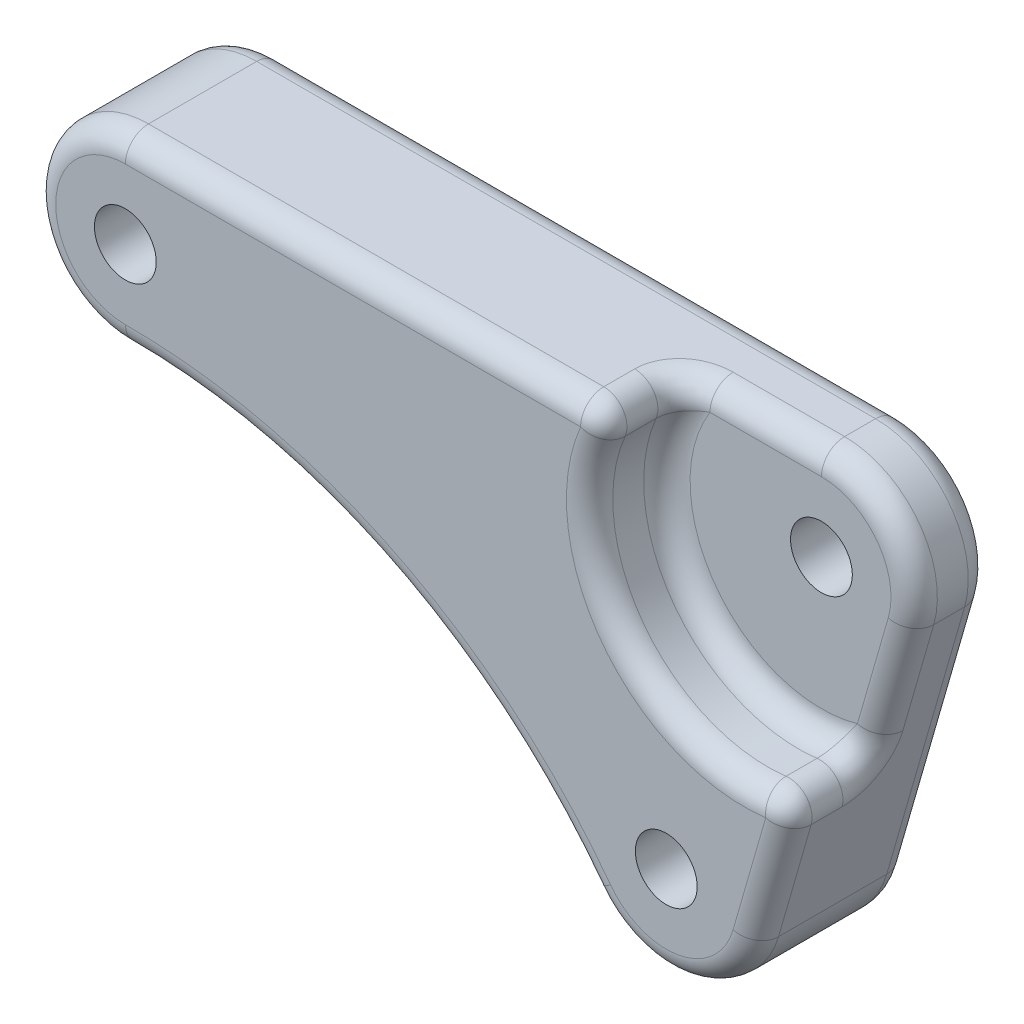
ISO-10303-21;
HEADER;
FILE_DESCRIPTION(('STEP AP214'),'2;1');
FILE_NAME('part.step','',(''),(''),'','','');
FILE_SCHEMA(('AUTOMOTIVE_DESIGN { 1 0 10303 214 1 1 1 1 }'));
ENDSEC;
DATA;
#1=APPLICATION_CONTEXT('core data for automotive mechanical design processes');
#2=APPLICATION_PROTOCOL_DEFINITION('international standard','automotive_design',2000,#1);
#3=PRODUCT_CONTEXT('',#1,'mechanical');
#4=PRODUCT('Part','Part','',(#3));
#5=PRODUCT_RELATED_PRODUCT_CATEGORY('part','',(#4));
#6=PRODUCT_DEFINITION_FORMATION('','',#4);
#7=PRODUCT_DEFINITION_CONTEXT('part definition',#1,'design');
#8=PRODUCT_DEFINITION('design','',#6,#7);
#9=PRODUCT_DEFINITION_SHAPE('','',#8);
#10=(LENGTH_UNIT() NAMED_UNIT(*) SI_UNIT(.MILLI.,.METRE.));
#11=(NAMED_UNIT(*) PLANE_ANGLE_UNIT() SI_UNIT($,.RADIAN.));
#12=(NAMED_UNIT(*) SI_UNIT($,.STERADIAN.) SOLID_ANGLE_UNIT());
#13=UNCERTAINTY_MEASURE_WITH_UNIT(LENGTH_MEASURE(1.E-05),#10,'distance_accuracy_value','');
#14=(GEOMETRIC_REPRESENTATION_CONTEXT(3) GLOBAL_UNCERTAINTY_ASSIGNED_CONTEXT((#13)) GLOBAL_UNIT_ASSIGNED_CONTEXT((#10,
#11,#12)) REPRESENTATION_CONTEXT('',''));
#15=CARTESIAN_POINT('',(0.,0.,0.));
#16=DIRECTION('',(0.,0.,1.));
#17=DIRECTION('',(1.,0.,0.));
#18=AXIS2_PLACEMENT_3D('',#15,#16,#17);
#19=CARTESIAN_POINT('',(80.0820241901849,0.,20.));
#20=DIRECTION('',(0.,0.,-1.));
#21=DIRECTION('',(-1.,0.,0.));
#22=AXIS2_PLACEMENT_3D('',#19,#20,#21);
#23=CYLINDRICAL_SURFACE('',#22,12.);
#24=DIRECTION('',(0.,0.,-1.));
#25=VECTOR('',#24,1.);
#26=CARTESIAN_POINT('',(80.0820241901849,12.,20.));
#27=LINE('',#26,#25);
#28=CARTESIAN_POINT('',(80.0820241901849,12.,7.));
#29=VERTEX_POINT('',#28);
#30=CARTESIAN_POINT('',(80.0820241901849,12.,3.));
#31=VERTEX_POINT('',#30);
#32=EDGE_CURVE('E389',#29,#31,#27,.T.);
#33=ORIENTED_EDGE('',*,*,#32,.F.);
#34=CARTESIAN_POINT('',(80.0820241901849,0.,7.));
#35=DIRECTION('',(0.,0.,1.));
#36=DIRECTION('',(1.,0.,0.));
#37=AXIS2_PLACEMENT_3D('',#34,#35,#36);
#38=CIRCLE('',#37,12.);
#39=CARTESIAN_POINT('',(91.6131461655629,-3.32163001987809,7.));
#40=VERTEX_POINT('',#39);
#41=EDGE_CURVE('E272',#29,#40,#38,.F.);
#42=ORIENTED_EDGE('',*,*,#41,.T.);
#43=DIRECTION('',(0.,0.,-1.));
#44=VECTOR('',#43,1.);
#45=CARTESIAN_POINT('',(91.6131461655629,-3.32163001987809,20.));
#46=LINE('',#45,#44);
#47=CARTESIAN_POINT('',(91.6131461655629,-3.32163001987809,3.));
#48=VERTEX_POINT('',#47);
#49=EDGE_CURVE('E393',#40,#48,#46,.T.);
#50=ORIENTED_EDGE('',*,*,#49,.T.);
#51=CARTESIAN_POINT('',(80.0820241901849,0.,3.));
#52=DIRECTION('',(0.,0.,-1.));
#53=DIRECTION('',(-1.,0.,0.));
#54=AXIS2_PLACEMENT_3D('',#51,#52,#53);
#55=CIRCLE('',#54,12.);
#56=EDGE_CURVE('E220',#48,#31,#55,.F.);
#57=ORIENTED_EDGE('',*,*,#56,.T.);
#58=EDGE_LOOP('',(#33,#42,#50,#57));
#59=FACE_BOUND('',#58,.T.);
#60=ADVANCED_FACE('F37',(#59),#23,.T.);
#61=CARTESIAN_POINT('',(80.0820241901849,0.,20.));
#62=DIRECTION('',(0.,0.,-1.));
#63=DIRECTION('',(-1.,0.,0.));
#64=AXIS2_PLACEMENT_3D('',#61,#62,#63);
#65=CYLINDRICAL_SURFACE('',#64,3.99999999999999);
#66=CARTESIAN_POINT('',(80.0820241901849,0.,0.));
#67=DIRECTION('',(0.,0.,1.));
#68=DIRECTION('',(1.,0.,0.));
#69=AXIS2_PLACEMENT_3D('',#66,#67,#68);
#70=CIRCLE('',#69,3.99999999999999);
#71=CARTESIAN_POINT('',(84.0820241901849,0.,0.));
#72=VERTEX_POINT('',#71);
#73=EDGE_CURVE('E492',#72,#72,#70,.T.);
#74=ORIENTED_EDGE('',*,*,#73,.F.);
#75=EDGE_LOOP('',(#74));
#76=FACE_BOUND('',#75,.T.);
#77=CARTESIAN_POINT('',(80.0820241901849,0.,10.));
#78=DIRECTION('',(0.,0.,1.));
#79=DIRECTION('',(1.,0.,0.));
#80=AXIS2_PLACEMENT_3D('',#77,#78,#79);
#81=CIRCLE('',#80,3.99999999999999);
#82=CARTESIAN_POINT('',(84.0820241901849,0.,10.));
#83=VERTEX_POINT('',#82);
#84=EDGE_CURVE('E201',#83,#83,#81,.T.);
#85=ORIENTED_EDGE('',*,*,#84,.T.);
#86=EDGE_LOOP('',(#85));
#87=FACE_BOUND('',#86,.T.);
#88=ADVANCED_FACE('F381',(#76,#87),#65,.F.);
#89=CARTESIAN_POINT('',(0.250179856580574,-86.9996402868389,20.));
#90=DIRECTION('',(0.,0.,-1.));
#91=DIRECTION('',(-1.,0.,0.));
#92=AXIS2_PLACEMENT_3D('',#89,#90,#91);
#93=PLANE('',#92);
#94=DIRECTION('',(0.276802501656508,0.960926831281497,0.));
#95=VECTOR('',#94,1.);
#96=CARTESIAN_POINT('',(59.4729106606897,-104.059211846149,20.));
#97=LINE('',#96,#95);
#98=CARTESIAN_POINT('',(78.6483414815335,-37.4912225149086,20.));
#99=VERTEX_POINT('',#98);
#100=CARTESIAN_POINT('',(82.8715610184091,-22.8302099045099,20.));
#101=VERTEX_POINT('',#100);
#102=EDGE_CURVE('E176',#99,#101,#97,.T.);
#103=ORIENTED_EDGE('',*,*,#102,.T.);
#104=CARTESIAN_POINT('',(80.0820241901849,0.,20.));
#105=DIRECTION('',(0.,0.,-1.));
#106=DIRECTION('',(-1.,0.,0.));
#107=AXIS2_PLACEMENT_3D('',#104,#105,#106);
#108=CIRCLE('',#107,23.);
#109=CARTESIAN_POINT('',(58.9160137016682,8.99999999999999,20.));
#110=VERTEX_POINT('',#109);
#111=EDGE_CURVE('E11',#101,#110,#108,.T.);
#112=ORIENTED_EDGE('',*,*,#111,.T.);
#113=DIRECTION('',(-1.,0.,0.));
#114=VECTOR('',#113,1.);
#115=CARTESIAN_POINT('',(0.250179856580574,8.99999999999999,20.));
#116=LINE('',#115,#114);
#117=CARTESIAN_POINT('',(0.,9.,20.));
#118=VERTEX_POINT('',#117);
#119=EDGE_CURVE('E166',#110,#118,#116,.T.);
#120=ORIENTED_EDGE('',*,*,#119,.T.);
#121=CARTESIAN_POINT('',(0.,0.,20.));
#122=DIRECTION('',(0.,0.,-1.));
#123=DIRECTION('',(-1.,0.,0.));
#124=AXIS2_PLACEMENT_3D('',#121,#122,#123);
#125=CIRCLE('',#124,9.);
#126=CARTESIAN_POINT('',(0.0258806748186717,-8.99996278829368,20.));
#127=VERTEX_POINT('',#126);
#128=EDGE_CURVE('E171',#118,#127,#125,.F.);
#129=ORIENTED_EDGE('',*,*,#128,.T.);
#130=CARTESIAN_POINT('',(0.250179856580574,-86.9996402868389,20.));
#131=DIRECTION('',(0.,0.,-1.));
#132=DIRECTION('',(-1.,0.,0.));
#133=AXIS2_PLACEMENT_3D('',#130,#131,#132);
#134=CIRCLE('',#133,78.);
#135=CARTESIAN_POINT('',(62.7845013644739,-40.3792731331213,20.));
#136=VERTEX_POINT('',#135);
#137=EDGE_CURVE('E192',#127,#136,#134,.T.);
#138=ORIENTED_EDGE('',*,*,#137,.T.);
#139=CARTESIAN_POINT('',(70.,-35.,20.));
#140=DIRECTION('',(0.,0.,-1.));
#141=DIRECTION('',(-1.,0.,0.));
#142=AXIS2_PLACEMENT_3D('',#139,#140,#141);
#143=CIRCLE('',#142,8.99999999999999);
#144=EDGE_CURVE('E195',#136,#99,#143,.F.);
#145=ORIENTED_EDGE('',*,*,#144,.T.);
#146=EDGE_LOOP('',(#103,#112,#120,#129,#138,#145));
#147=FACE_BOUND('',#146,.T.);
#148=CARTESIAN_POINT('',(0.,0.,20.));
#149=DIRECTION('',(0.,0.,1.));
#150=DIRECTION('',(1.,0.,0.));
#151=AXIS2_PLACEMENT_3D('',#148,#149,#150);
#152=CIRCLE('',#151,4.);
#153=CARTESIAN_POINT('',(4.,0.,20.));
#154=VERTEX_POINT('',#153);
#155=EDGE_CURVE('E505',#154,#154,#152,.T.);
#156=ORIENTED_EDGE('',*,*,#155,.F.);
#157=EDGE_LOOP('',(#156));
#158=FACE_BOUND('',#157,.T.);
#159=CARTESIAN_POINT('',(70.,-35.,20.));
#160=DIRECTION('',(0.,0.,1.));
#161=DIRECTION('',(1.,0.,0.));
#162=AXIS2_PLACEMENT_3D('',#159,#160,#161);
#163=CIRCLE('',#162,4.00000000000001);
#164=CARTESIAN_POINT('',(74.,-35.,20.));
#165=VERTEX_POINT('',#164);
#166=EDGE_CURVE('E499',#165,#165,#163,.T.);
#167=ORIENTED_EDGE('',*,*,#166,.F.);
#168=EDGE_LOOP('',(#167));
#169=FACE_BOUND('',#168,.T.);
#170=ADVANCED_FACE('F168',(#147,#158,#169),#93,.F.);
#171=CARTESIAN_POINT('',(0.250179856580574,-86.9996402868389,0.));
#172=DIRECTION('',(0.,0.,-1.));
#173=DIRECTION('',(-1.,0.,0.));
#174=AXIS2_PLACEMENT_3D('',#171,#172,#173);
#175=PLANE('',#174);
#176=DIRECTION('',(-1.,0.,0.));
#177=VECTOR('',#176,1.);
#178=CARTESIAN_POINT('',(80.0820241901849,9.,0.));
#179=LINE('',#178,#177);
#180=CARTESIAN_POINT('',(0.,9.,0.));
#181=VERTEX_POINT('',#180);
#182=CARTESIAN_POINT('',(80.0820241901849,9.,0.));
#183=VERTEX_POINT('',#182);
#184=EDGE_CURVE('E223',#181,#183,#179,.F.);
#185=ORIENTED_EDGE('',*,*,#184,.T.);
#186=CARTESIAN_POINT('',(80.0820241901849,0.,0.));
#187=DIRECTION('',(0.,0.,-1.));
#188=DIRECTION('',(-1.,0.,0.));
#189=AXIS2_PLACEMENT_3D('',#186,#187,#188);
#190=CIRCLE('',#189,9.00000000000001);
#191=CARTESIAN_POINT('',(88.7303656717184,-2.49122251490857,0.));
#192=VERTEX_POINT('',#191);
#193=EDGE_CURVE('E233',#183,#192,#190,.T.);
#194=ORIENTED_EDGE('',*,*,#193,.T.);
#195=DIRECTION('',(0.276802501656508,0.960926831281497,0.));
#196=VECTOR('',#195,1.);
#197=CARTESIAN_POINT('',(78.6483414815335,-37.4912225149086,0.));
#198=LINE('',#197,#196);
#199=CARTESIAN_POINT('',(78.6483414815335,-37.4912225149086,0.));
#200=VERTEX_POINT('',#199);
#201=EDGE_CURVE('E231',#192,#200,#198,.F.);
#202=ORIENTED_EDGE('',*,*,#201,.T.);
#203=CARTESIAN_POINT('',(70.,-35.,0.));
#204=DIRECTION('',(0.,0.,-1.));
#205=DIRECTION('',(-1.,0.,0.));
#206=AXIS2_PLACEMENT_3D('',#203,#204,#205);
#207=CIRCLE('',#206,8.99999999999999);
#208=CARTESIAN_POINT('',(62.7845013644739,-40.3792731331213,0.));
#209=VERTEX_POINT('',#208);
#210=EDGE_CURVE('E229',#200,#209,#207,.T.);
#211=ORIENTED_EDGE('',*,*,#210,.T.);
#212=CARTESIAN_POINT('',(0.250179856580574,-86.9996402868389,0.));
#213=DIRECTION('',(0.,0.,-1.));
#214=DIRECTION('',(-1.,0.,0.));
#215=AXIS2_PLACEMENT_3D('',#212,#213,#214);
#216=CIRCLE('',#215,78.);
#217=CARTESIAN_POINT('',(0.0258806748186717,-8.99996278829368,0.));
#218=VERTEX_POINT('',#217);
#219=EDGE_CURVE('E227',#209,#218,#216,.F.);
#220=ORIENTED_EDGE('',*,*,#219,.T.);
#221=CARTESIAN_POINT('',(0.,0.,0.));
#222=DIRECTION('',(0.,0.,-1.));
#223=DIRECTION('',(-1.,0.,0.));
#224=AXIS2_PLACEMENT_3D('',#221,#222,#223);
#225=CIRCLE('',#224,9.);
#226=EDGE_CURVE('E225',#218,#181,#225,.T.);
#227=ORIENTED_EDGE('',*,*,#226,.T.);
#228=EDGE_LOOP('',(#185,#194,#202,#211,#220,#227));
#229=FACE_BOUND('',#228,.T.);
#230=CARTESIAN_POINT('',(70.,-35.,0.));
#231=DIRECTION('',(0.,0.,1.));
#232=DIRECTION('',(1.,0.,0.));
#233=AXIS2_PLACEMENT_3D('',#230,#231,#232);
#234=CIRCLE('',#233,4.00000000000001);
#235=CARTESIAN_POINT('',(74.,-35.,0.));
#236=VERTEX_POINT('',#235);
#237=EDGE_CURVE('E494',#236,#236,#234,.T.);
#238=ORIENTED_EDGE('',*,*,#237,.T.);
#239=EDGE_LOOP('',(#238));
#240=FACE_BOUND('',#239,.T.);
#241=CARTESIAN_POINT('',(0.,0.,0.));
#242=DIRECTION('',(0.,0.,1.));
#243=DIRECTION('',(1.,0.,0.));
#244=AXIS2_PLACEMENT_3D('',#241,#242,#243);
#245=CIRCLE('',#244,4.);
#246=CARTESIAN_POINT('',(4.,0.,0.));
#247=VERTEX_POINT('',#246);
#248=EDGE_CURVE('E503',#247,#247,#245,.T.);
#249=ORIENTED_EDGE('',*,*,#248,.T.);
#250=EDGE_LOOP('',(#249));
#251=FACE_BOUND('',#250,.T.);
#252=ORIENTED_EDGE('',*,*,#73,.T.);
#253=EDGE_LOOP('',(#252));
#254=FACE_BOUND('',#253,.T.);
#255=ADVANCED_FACE('F653',(#229,#240,#251,#254),#175,.T.);
#256=CARTESIAN_POINT('',(0.250179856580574,-86.9996402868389,20.));
#257=DIRECTION('',(0.,0.,-1.));
#258=DIRECTION('',(-1.,0.,0.));
#259=AXIS2_PLACEMENT_3D('',#256,#257,#258);
#260=CYLINDRICAL_SURFACE('',#259,75.);
#261=DIRECTION('',(0.,0.,-1.));
#262=VECTOR('',#261,1.);
#263=CARTESIAN_POINT('',(60.3793351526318,-42.172364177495,20.));
#264=LINE('',#263,#262);
#265=CARTESIAN_POINT('',(60.3793351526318,-42.172364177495,17.));
#266=VERTEX_POINT('',#265);
#267=CARTESIAN_POINT('',(60.3793351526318,-42.172364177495,3.));
#268=VERTEX_POINT('',#267);
#269=EDGE_CURVE('E193',#266,#268,#264,.T.);
#270=ORIENTED_EDGE('',*,*,#269,.F.);
#271=CARTESIAN_POINT('',(0.250179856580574,-86.9996402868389,17.));
#272=DIRECTION('',(0.,0.,-1.));
#273=DIRECTION('',(-1.,0.,0.));
#274=AXIS2_PLACEMENT_3D('',#271,#272,#273);
#275=CIRCLE('',#274,75.);
#276=CARTESIAN_POINT('',(0.0345075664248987,-11.9999503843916,17.));
#277=VERTEX_POINT('',#276);
#278=EDGE_CURVE('E218',#266,#277,#275,.F.);
#279=ORIENTED_EDGE('',*,*,#278,.T.);
#280=DIRECTION('',(0.,0.,-1.));
#281=VECTOR('',#280,1.);
#282=CARTESIAN_POINT('',(0.0345075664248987,-11.9999503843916,20.));
#283=LINE('',#282,#281);
#284=CARTESIAN_POINT('',(0.0345075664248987,-11.9999503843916,3.));
#285=VERTEX_POINT('',#284);
#286=EDGE_CURVE('E508',#277,#285,#283,.T.);
#287=ORIENTED_EDGE('',*,*,#286,.T.);
#288=CARTESIAN_POINT('',(0.250179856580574,-86.9996402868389,3.));
#289=DIRECTION('',(0.,0.,-1.));
#290=DIRECTION('',(-1.,0.,0.));
#291=AXIS2_PLACEMENT_3D('',#288,#289,#290);
#292=CIRCLE('',#291,75.);
#293=EDGE_CURVE('E216',#285,#268,#292,.T.);
#294=ORIENTED_EDGE('',*,*,#293,.T.);
#295=EDGE_LOOP('',(#270,#279,#287,#294));
#296=FACE_BOUND('',#295,.T.);
#297=ADVANCED_FACE('F552',(#296),#260,.F.);
#298=CARTESIAN_POINT('',(70.,-35.,20.));
#299=DIRECTION('',(0.,0.,-1.));
#300=DIRECTION('',(-1.,0.,0.));
#301=AXIS2_PLACEMENT_3D('',#298,#299,#300);
#302=CYLINDRICAL_SURFACE('',#301,12.);
#303=DIRECTION('',(0.,0.,-1.));
#304=VECTOR('',#303,1.);
#305=CARTESIAN_POINT('',(81.531121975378,-38.3216300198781,20.));
#306=LINE('',#305,#304);
#307=CARTESIAN_POINT('',(81.531121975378,-38.3216300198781,17.));
#308=VERTEX_POINT('',#307);
#309=CARTESIAN_POINT('',(81.531121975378,-38.3216300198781,3.));
#310=VERTEX_POINT('',#309);
#311=EDGE_CURVE('E198',#308,#310,#306,.T.);
#312=ORIENTED_EDGE('',*,*,#311,.F.);
#313=CARTESIAN_POINT('',(70.,-35.,17.));
#314=DIRECTION('',(0.,0.,-1.));
#315=DIRECTION('',(-1.,0.,0.));
#316=AXIS2_PLACEMENT_3D('',#313,#314,#315);
#317=CIRCLE('',#316,12.);
#318=EDGE_CURVE('E214',#308,#266,#317,.T.);
#319=ORIENTED_EDGE('',*,*,#318,.T.);
#320=ORIENTED_EDGE('',*,*,#269,.T.);
#321=CARTESIAN_POINT('',(70.,-35.,3.));
#322=DIRECTION('',(0.,0.,-1.));
#323=DIRECTION('',(-1.,0.,0.));
#324=AXIS2_PLACEMENT_3D('',#321,#322,#323);
#325=CIRCLE('',#324,12.);
#326=EDGE_CURVE('E212',#268,#310,#325,.F.);
#327=ORIENTED_EDGE('',*,*,#326,.T.);
#328=EDGE_LOOP('',(#312,#319,#320,#327));
#329=FACE_BOUND('',#328,.T.);
#330=ADVANCED_FACE('F554',(#329),#302,.T.);
#331=CARTESIAN_POINT('',(81.531121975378,-38.3216300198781,20.));
#332=DIRECTION('',(-0.960926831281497,0.276802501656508,0.));
#333=DIRECTION('',(-0.276802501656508,-0.960926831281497,0.));
#334=AXIS2_PLACEMENT_3D('',#331,#332,#333);
#335=PLANE('',#334);
#336=ORIENTED_EDGE('',*,*,#49,.F.);
#337=DIRECTION('',(0.276802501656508,0.960926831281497,0.));
#338=VECTOR('',#337,1.);
#339=CARTESIAN_POINT('',(87.1843061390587,-18.696459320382,7.));
#340=LINE('',#339,#338);
#341=CARTESIAN_POINT('',(87.6210437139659,-17.1803138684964,7.));
#342=VERTEX_POINT('',#341);
#343=EDGE_CURVE('E456',#40,#342,#340,.F.);
#344=ORIENTED_EDGE('',*,*,#343,.T.);
#345=CARTESIAN_POINT('',(86.0246884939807,-14.6153789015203,10.2604543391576));
#346=CARTESIAN_POINT('',(88.2345078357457,-15.05065777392,9.70902145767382));
#347=CARTESIAN_POINT('',(88.4469453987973,-14.3131754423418,7.52090867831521));
#348=CARTESIAN_POINT('',(85.9118098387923,-14.7624949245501,10.2186126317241));
#349=CARTESIAN_POINT('',(88.1786954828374,-15.2444117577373,9.6980634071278));
#350=CARTESIAN_POINT('',(88.3808962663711,-14.5424666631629,7.43722526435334));
#351=CARTESIAN_POINT('',(85.800008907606,-14.9091677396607,10.1814492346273));
#352=CARTESIAN_POINT('',(88.1240410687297,-15.4341459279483,9.69652270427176));
#353=CARTESIAN_POINT('',(88.3139247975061,-14.774959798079,7.36289846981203));
#354=CARTESIAN_POINT('',(85.579088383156,-15.2013289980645,10.1169811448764));
#355=CARTESIAN_POINT('',(88.0165425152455,-15.8073298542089,9.71090575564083));
#356=CARTESIAN_POINT('',(88.1784795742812,-15.2451612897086,7.23396228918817));
#357=CARTESIAN_POINT('',(85.469971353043,-15.3468162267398,10.0896855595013));
#358=CARTESIAN_POINT('',(87.9637437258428,-15.9906221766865,9.72717373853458));
#359=CARTESIAN_POINT('',(88.1100044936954,-15.4828742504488,7.17937111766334));
#360=CARTESIAN_POINT('',(85.2546829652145,-15.636670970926,10.0454372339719));
#361=CARTESIAN_POINT('',(87.860487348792,-16.3490792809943,9.77670554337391));
#362=CARTESIAN_POINT('',(87.9717145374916,-15.9629513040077,7.09087446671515));
#363=CARTESIAN_POINT('',(85.1485266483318,-15.7810307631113,10.0285304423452));
#364=CARTESIAN_POINT('',(87.8101110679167,-16.5239618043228,9.810360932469));
#365=CARTESIAN_POINT('',(87.9018950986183,-16.2053312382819,7.05706088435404));
#366=CARTESIAN_POINT('',(84.9402683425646,-16.0673600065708,10.005811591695));
#367=CARTESIAN_POINT('',(87.7126540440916,-16.8622863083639,9.89358829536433));
#368=CARTESIAN_POINT('',(87.7617444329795,-16.6918677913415,7.01162318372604));
#369=CARTESIAN_POINT('',(84.8381647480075,-16.2093303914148,9.99999509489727));
#370=CARTESIAN_POINT('',(87.6656582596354,-17.0254333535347,9.94344316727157));
#371=CARTESIAN_POINT('',(87.6914134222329,-16.9360236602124,6.99999018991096));
#372=CARTESIAN_POINT('',(84.5703221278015,-16.5862238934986,10.0000082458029));
#373=CARTESIAN_POINT('',(87.5440994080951,-17.4474279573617,10.0975405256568));
#374=CARTESIAN_POINT('',(87.5027475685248,-17.5909819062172,7.00001649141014));
#375=CARTESIAN_POINT('',(84.4086040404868,-16.8186008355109,10.0164676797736));
#376=CARTESIAN_POINT('',(87.4742805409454,-17.6898059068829,10.2149578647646));
#377=CARTESIAN_POINT('',(87.3843420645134,-18.0020295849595,7.03293535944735));
#378=CARTESIAN_POINT('',(84.1004209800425,-17.2707807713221,10.0844706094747));
#379=CARTESIAN_POINT('',(87.3483941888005,-18.1268235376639,10.479566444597));
#380=CARTESIAN_POINT('',(87.1508308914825,-18.8126694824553,7.16894121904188));
#381=CARTESIAN_POINT('',(83.9539293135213,-17.4906054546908,10.1359514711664));
#382=CARTESIAN_POINT('',(87.2929036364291,-18.3194603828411,10.6273311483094));
#383=CARTESIAN_POINT('',(87.035719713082,-19.2122808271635,7.27190294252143));
#384=CARTESIAN_POINT('',(83.6770629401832,-17.9145249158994,10.2756366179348));
#385=CARTESIAN_POINT('',(87.1967021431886,-18.6534262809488,10.9397440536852));
#386=CARTESIAN_POINT('',(86.8115156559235,-19.9906108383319,7.55127323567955));
#387=CARTESIAN_POINT('',(83.5468096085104,-18.1184973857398,10.3640981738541));
#388=CARTESIAN_POINT('',(87.1567492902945,-18.7921236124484,11.1044161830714));
#389=CARTESIAN_POINT('',(86.702471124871,-20.3691616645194,7.72819634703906));
#390=CARTESIAN_POINT('',(83.3060931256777,-18.5023765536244,10.5774203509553));
#391=CARTESIAN_POINT('',(87.0920931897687,-19.0165788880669,11.4328199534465));
#392=CARTESIAN_POINT('',(86.4957670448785,-21.0867400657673,8.1548407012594));
#393=CARTESIAN_POINT('',(83.195627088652,-18.6822867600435,10.7022756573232));
#394=CARTESIAN_POINT('',(87.0679585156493,-19.1003630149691,11.595804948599));
#395=CARTESIAN_POINT('',(86.3981058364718,-21.4257734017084,8.40455131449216));
#396=CARTESIAN_POINT('',(83.0092978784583,-18.9903270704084,10.9680612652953));
#397=CARTESIAN_POINT('',(87.0348389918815,-19.215338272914,11.8855439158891));
#398=CARTESIAN_POINT('',(86.2300656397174,-22.0091291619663,8.93612253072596));
#399=CARTESIAN_POINT('',(82.9308484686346,-19.1221056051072,11.1051170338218));
#400=CARTESIAN_POINT('',(87.0246059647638,-19.2508624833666,12.0137725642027));
#401=CARTESIAN_POINT('',(86.1578078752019,-22.2599738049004,9.21023406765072));
#402=CARTESIAN_POINT('',(82.7927892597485,-19.3563977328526,11.4013972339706));
#403=CARTESIAN_POINT('',(87.0112220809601,-19.29732497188,12.2502788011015));
#404=CARTESIAN_POINT('',(86.0289579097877,-22.7072796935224,9.802794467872));
#405=CARTESIAN_POINT('',(82.7331584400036,-19.4589439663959,11.5605966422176));
#406=CARTESIAN_POINT('',(87.0082159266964,-19.3077609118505,12.3576927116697));
#407=CARTESIAN_POINT('',(85.972348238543,-22.9038015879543,10.1211932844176));
#408=CARTESIAN_POINT('',(82.6393956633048,-19.6212913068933,11.8779329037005));
#409=CARTESIAN_POINT('',(87.0059278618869,-19.3157039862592,12.5410888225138));
#410=CARTESIAN_POINT('',(85.8825648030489,-23.2154870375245,10.7558658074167));
#411=CARTESIAN_POINT('',(82.603218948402,-19.6844906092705,12.0343631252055));
#412=CARTESIAN_POINT('',(87.006320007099,-19.3143426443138,12.6187367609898));
#413=CARTESIAN_POINT('',(85.8475323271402,-23.3371031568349,11.0687262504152));
#414=CARTESIAN_POINT('',(82.5477038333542,-19.7817940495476,12.3561595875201));
#415=CARTESIAN_POINT('',(87.0076929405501,-19.3095764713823,12.7612694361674));
#416=CARTESIAN_POINT('',(85.7935509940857,-23.5245007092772,11.7123191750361));
#417=CARTESIAN_POINT('',(82.5283614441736,-19.8159050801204,12.5215237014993));
#418=CARTESIAN_POINT('',(87.0086748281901,-19.3061678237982,12.8257578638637));
#419=CARTESIAN_POINT('',(85.7745983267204,-23.5902953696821,12.0430474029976));
#420=CARTESIAN_POINT('',(82.5126285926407,-19.8436671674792,12.7668436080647));
#421=CARTESIAN_POINT('',(87.0095178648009,-19.3032412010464,12.9164352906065));
#422=CARTESIAN_POINT('',(85.7591710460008,-23.6438515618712,12.5336872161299));
#423=CARTESIAN_POINT('',(82.5095068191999,-19.8491803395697,12.8456125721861));
#424=CARTESIAN_POINT('',(87.0096966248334,-19.3026206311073,12.9447908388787));
#425=CARTESIAN_POINT('',(85.7561068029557,-23.6544891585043,12.6912251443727));
#426=CARTESIAN_POINT('',(82.5070749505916,-19.8534748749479,13.0033568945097));
#427=CARTESIAN_POINT('',(87.0098353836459,-19.3021389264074,13.0012412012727));
#428=CARTESIAN_POINT('',(85.75371991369,-23.6627753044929,13.0067137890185));
#429=CARTESIAN_POINT('',(82.5077647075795,-19.852256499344,13.0823322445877));
#430=CARTESIAN_POINT('',(87.0097952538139,-19.3022782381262,13.0293081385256));
#431=CARTESIAN_POINT('',(85.7543971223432,-23.6604243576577,13.1646644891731));
#432=CARTESIAN_POINT('',(82.5129621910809,-19.8430785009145,13.2399939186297));
#433=CARTESIAN_POINT('',(87.0095000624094,-19.3033030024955,13.086152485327));
#434=CARTESIAN_POINT('',(85.7594981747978,-23.642715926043,13.4799878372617));
#435=CARTESIAN_POINT('',(82.517475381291,-19.8351092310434,13.3186796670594));
#436=CARTESIAN_POINT('',(87.0092449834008,-19.3041885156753,13.1149023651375));
#437=CARTESIAN_POINT('',(85.7639273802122,-23.627339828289,13.6373593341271));
#438=CARTESIAN_POINT('',(82.5302999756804,-19.812500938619,13.4750890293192));
#439=CARTESIAN_POINT('',(87.0086108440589,-19.3063899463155,13.1739736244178));
#440=CARTESIAN_POINT('',(85.776487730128,-23.5837362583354,13.9501780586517));
#441=CARTESIAN_POINT('',(82.5386117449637,-19.7978612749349,13.5528125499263));
#442=CARTESIAN_POINT('',(87.0082322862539,-19.3077041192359,13.2042637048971));
#443=CARTESIAN_POINT('',(85.7846192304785,-23.555507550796,14.1056250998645));
#444=CARTESIAN_POINT('',(82.5488088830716,-19.7799293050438,13.6297677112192));
#445=CARTESIAN_POINT('',(87.0078371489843,-19.3090758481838,13.2358189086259));
#446=CARTESIAN_POINT('',(85.7945755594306,-23.5209439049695,14.2595354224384));
#447=(BOUNDED_SURFACE() B_SPLINE_SURFACE(3,2,((#345,#346,#347),(#348,#349,#350),(#351,#352,
#353),(#354,#355,#356),(#357,#358,#359),(#360,#361,#362),(#363,#364,#365),(#366,#367,#368),
(#369,#370,#371),(#372,#373,#374),(#375,#376,#377),(#378,#379,#380),(#381,#382,#383),(#384,#385,
#386),(#387,#388,#389),(#390,#391,#392),(#393,#394,#395),(#396,#397,#398),(#399,#400,#401),
(#402,#403,#404),(#405,#406,#407),(#408,#409,#410),(#411,#412,#413),(#414,#415,#416),(#417,#418,
#419),(#420,#421,#422),(#423,#424,#425),(#426,#427,#428),(#429,#430,#431),(#432,#433,#434),
(#435,#436,#437),(#438,#439,#440),(#441,#442,#443),(#444,#445,#446)),.UNSPECIFIED.,.F.,.F.,
.F.) B_SPLINE_SURFACE_WITH_KNOTS((4,2,2,2,2,2,2,2,2,2,2,2,2,2,2,2,4),(3,3),(0.,
0.758463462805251,1.51762515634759,2.28012081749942,3.04231130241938,4.32360404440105,
5.60261126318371,6.89066850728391,8.17853774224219,9.30776871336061,10.435733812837,
11.4430869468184,12.4502013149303,12.9235175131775,13.3968153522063,13.8707906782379,
14.3448115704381),(0.,1.),
.UNSPECIFIED.) GEOMETRIC_REPRESENTATION_ITEM() RATIONAL_B_SPLINE_SURFACE(((1.,0.791205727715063,
1.),(1.,0.784071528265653,1.),(1.,0.776934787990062,1.),(1.,0.762708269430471,1.),(1.,
0.755618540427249,1.),(1.,0.741520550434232,1.),(1.,0.734512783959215,1.),(1.,0.720669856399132,
1.),(1.,0.713834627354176,1.),(1.,0.695796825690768,1.),(1.,0.684790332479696,1.),(1.,
0.663657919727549,1.),(1.,0.653530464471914,1.),(1.,0.634286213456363,1.),(1.,0.625177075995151,
1.),(1.,0.608280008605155,1.),(1.,0.600491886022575,1.),(1.,0.587323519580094,1.),(1.,
0.581764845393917,1.),(1.,0.571968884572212,1.),(1.,0.56773012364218,1.),(1.,0.561059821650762,
1.),(1.,0.558483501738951,1.),(1.,0.554528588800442,1.),(1.,0.553149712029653,1.),(1.,
0.552028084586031,1.),(1.,0.551805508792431,1.),(1.,0.551632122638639,1.),(1.,0.551681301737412,
1.),(1.,0.55205186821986,1.),(1.,0.552373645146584,1.),(1.,0.553287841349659,1.),(1.,
0.553880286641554,1.),(1.,0.554606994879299,1.))) REPRESENTATION_ITEM('') SURFACE());
#448=CARTESIAN_POINT('',(85.7945755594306,-23.5209439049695,14.2595354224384));
#449=CARTESIAN_POINT('',(85.7846192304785,-23.555507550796,14.1056250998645));
#450=CARTESIAN_POINT('',(85.776487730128,-23.5837362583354,13.9501780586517));
#451=CARTESIAN_POINT('',(85.7639273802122,-23.627339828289,13.6373593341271));
#452=CARTESIAN_POINT('',(85.7594981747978,-23.642715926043,13.4799878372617));
#453=CARTESIAN_POINT('',(85.7543971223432,-23.6604243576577,13.1646644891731));
#454=CARTESIAN_POINT('',(85.75371991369,-23.6627753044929,13.0067137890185));
#455=CARTESIAN_POINT('',(85.7561068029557,-23.6544891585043,12.6912251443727));
#456=CARTESIAN_POINT('',(85.7591710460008,-23.6438515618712,12.5336872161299));
#457=CARTESIAN_POINT('',(85.7745983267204,-23.5902953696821,12.0430474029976));
#458=CARTESIAN_POINT('',(85.7935509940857,-23.5245007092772,11.7123191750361));
#459=CARTESIAN_POINT('',(85.8475323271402,-23.3371031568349,11.0687262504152));
#460=CARTESIAN_POINT('',(85.8825648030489,-23.2154870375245,10.7558658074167));
#461=CARTESIAN_POINT('',(85.972348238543,-22.9038015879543,10.1211932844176));
#462=CARTESIAN_POINT('',(86.0289579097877,-22.7072796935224,9.802794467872));
#463=CARTESIAN_POINT('',(86.1578078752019,-22.2599738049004,9.21023406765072));
#464=CARTESIAN_POINT('',(86.2300656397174,-22.0091291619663,8.93612253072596));
#465=CARTESIAN_POINT('',(86.3981058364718,-21.4257734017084,8.40455131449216));
#466=CARTESIAN_POINT('',(86.4957670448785,-21.0867400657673,8.1548407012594));
#467=CARTESIAN_POINT('',(86.702471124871,-20.3691616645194,7.72819634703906));
#468=CARTESIAN_POINT('',(86.8115156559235,-19.9906108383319,7.55127323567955));
#469=CARTESIAN_POINT('',(87.0357197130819,-19.2122808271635,7.27190294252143));
#470=CARTESIAN_POINT('',(87.1508308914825,-18.8126694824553,7.16894121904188));
#471=CARTESIAN_POINT('',(87.3843420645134,-18.0020295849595,7.03293535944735));
#472=CARTESIAN_POINT('',(87.5027475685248,-17.5909819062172,7.00001649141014));
#473=CARTESIAN_POINT('',(87.6914134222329,-16.9360236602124,6.99999018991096));
#474=CARTESIAN_POINT('',(87.7617444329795,-16.6918677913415,7.01162318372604));
#475=CARTESIAN_POINT('',(87.9018950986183,-16.2053312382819,7.05706088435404));
#476=CARTESIAN_POINT('',(87.9717145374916,-15.9629513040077,7.09087446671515));
#477=CARTESIAN_POINT('',(88.1100044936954,-15.4828742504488,7.17937111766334));
#478=CARTESIAN_POINT('',(88.1784795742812,-15.2451612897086,7.23396228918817));
#479=CARTESIAN_POINT('',(88.3139247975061,-14.774959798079,7.36289846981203));
#480=CARTESIAN_POINT('',(88.3808962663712,-14.5424666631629,7.43722526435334));
#481=CARTESIAN_POINT('',(88.4469453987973,-14.3131754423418,7.52090867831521));
#482=B_SPLINE_CURVE_WITH_KNOTS('',3,(#448,#449,#450,#451,#452,#453,#454,#455,#456,#457,#458,
#459,#460,#461,#462,#463,#464,#465,#466,#467,#468,#469,#470,#471,#472,#473,#474,#475,#476,#477,
#478,#479,#480,#481),.UNSPECIFIED.,.F.,.F.,(4,2,2,2,2,2,2,2,2,2,2,2,2,2,2,2,4),(0.,
0.474020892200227,0.947996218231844,1.42129405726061,1.89461025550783,2.9017246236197,
3.90907775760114,5.03704285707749,6.16627382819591,7.45414306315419,8.7422003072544,
10.0212075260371,11.3025002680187,12.0646907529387,12.8271864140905,13.5863481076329,
14.3448115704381),.UNSPECIFIED.);
#483=CARTESIAN_POINT('',(85.7543415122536,-23.6606174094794,13.));
#484=VERTEX_POINT('',#483);
#485=EDGE_CURVE('E458',#484,#342,#482,.T.);
#486=ORIENTED_EDGE('',*,*,#485,.F.);
#487=DIRECTION('',(0.,0.,1.));
#488=VECTOR('',#487,1.);
#489=CARTESIAN_POINT('',(85.7543415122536,-23.6606174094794,20.));
#490=LINE('',#489,#488);
#491=CARTESIAN_POINT('',(85.7543415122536,-23.6606174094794,17.));
#492=VERTEX_POINT('',#491);
#493=EDGE_CURVE('E464',#484,#492,#490,.T.);
#494=ORIENTED_EDGE('',*,*,#493,.T.);
#495=DIRECTION('',(0.276802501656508,0.960926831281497,0.));
#496=VECTOR('',#495,1.);
#497=CARTESIAN_POINT('',(81.531121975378,-38.3216300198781,17.));
#498=LINE('',#497,#496);
#499=EDGE_CURVE('E210',#492,#308,#498,.F.);
#500=ORIENTED_EDGE('',*,*,#499,.T.);
#501=ORIENTED_EDGE('',*,*,#311,.T.);
#502=DIRECTION('',(0.276802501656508,0.960926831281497,0.));
#503=VECTOR('',#502,1.);
#504=CARTESIAN_POINT('',(91.6131461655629,-3.32163001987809,3.));
#505=LINE('',#504,#503);
#506=EDGE_CURVE('E207',#310,#48,#505,.T.);
#507=ORIENTED_EDGE('',*,*,#506,.T.);
#508=EDGE_LOOP('',(#336,#344,#486,#494,#500,#501,#507));
#509=FACE_BOUND('',#508,.T.);
#510=ADVANCED_FACE('F296',(#509),#335,.F.);
#511=CARTESIAN_POINT('',(0.,12.,20.));
#512=DIRECTION('',(0.,-1.,0.));
#513=DIRECTION('',(0.,0.,-1.));
#514=AXIS2_PLACEMENT_3D('',#511,#512,#513);
#515=PLANE('',#514);
#516=CARTESIAN_POINT('',(61.8509845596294,7.86813221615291,13.9169165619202));
#517=CARTESIAN_POINT('',(63.4399833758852,12.,13.3613732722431));
#518=CARTESIAN_POINT('',(59.2283638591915,12.,14.8338331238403));
#519=CARTESIAN_POINT('',(61.822240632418,7.86113014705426,13.8433732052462));
#520=CARTESIAN_POINT('',(63.4408141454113,12.,13.3267811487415));
#521=CARTESIAN_POINT('',(59.1769184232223,12.,14.6867464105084));
#522=CARTESIAN_POINT('',(61.7969554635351,7.85499977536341,13.7687548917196));
#523=CARTESIAN_POINT('',(63.4420333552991,12.,13.2938515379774));
#524=CARTESIAN_POINT('',(59.131618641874,12.,14.5375097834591));
#525=CARTESIAN_POINT('',(61.7534599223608,7.84448699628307,13.6178860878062));
#526=CARTESIAN_POINT('',(63.4446878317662,12.,13.230421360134));
#527=CARTESIAN_POINT('',(59.0536438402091,12.,14.2357721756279));
#528=CARTESIAN_POINT('',(61.7352496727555,7.8401046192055,13.5416355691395));
#529=CARTESIAN_POINT('',(63.4461224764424,12.,13.1999574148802));
#530=CARTESIAN_POINT('',(59.0209690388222,12.,14.0832711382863));
#531=CARTESIAN_POINT('',(61.7060755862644,7.83309584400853,13.3880928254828));
#532=CARTESIAN_POINT('',(63.4486338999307,12.,13.1407753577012));
#533=CARTESIAN_POINT('',(58.9686033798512,12.,13.7761856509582));
#534=CARTESIAN_POINT('',(61.6951051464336,7.8304678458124,13.3108016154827));
#535=CARTESIAN_POINT('',(63.4497091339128,12.,13.1120869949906));
#536=CARTESIAN_POINT('',(58.9489006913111,12.,13.6216032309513));
#537=CARTESIAN_POINT('',(61.6804634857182,7.82696306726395,13.1556872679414));
#538=CARTESIAN_POINT('',(63.4511921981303,12.,13.0555906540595));
#539=CARTESIAN_POINT('',(58.9226005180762,12.,13.3113745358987));
#540=CARTESIAN_POINT('',(61.676792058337,7.82608623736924,13.0778641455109));
#541=CARTESIAN_POINT('',(63.4515986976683,12.,13.0278105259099));
#542=CARTESIAN_POINT('',(58.9160026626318,12.,13.1557282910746));
#543=CARTESIAN_POINT('',(61.6768090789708,7.82608841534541,12.8420501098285));
#544=CARTESIAN_POINT('',(63.4515644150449,12.,12.9435855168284));
#545=CARTESIAN_POINT('',(58.9160360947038,12.,12.6841002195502));
#546=CARTESIAN_POINT('',(61.6919513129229,7.82970093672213,12.6839314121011));
#547=CARTESIAN_POINT('',(63.4498235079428,12.,12.8872126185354));
#548=CARTESIAN_POINT('',(58.9432536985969,12.,12.3678628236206));
#549=CARTESIAN_POINT('',(61.7520315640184,7.84413805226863,12.3724608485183));
#550=CARTESIAN_POINT('',(63.4447127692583,12.,12.7668792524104));
#551=CARTESIAN_POINT('',(59.0510888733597,12.,11.7449216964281));
#552=CARTESIAN_POINT('',(61.7969623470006,7.85496089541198,12.2191078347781));
#553=CARTESIAN_POINT('',(63.4413596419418,12.,12.7031843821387));
#554=CARTESIAN_POINT('',(59.1316934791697,12.,11.4382156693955));
#555=CARTESIAN_POINT('',(61.9150629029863,7.88375457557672,11.9215194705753));
#556=CARTESIAN_POINT('',(63.4383503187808,12.,12.5625873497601));
#557=CARTESIAN_POINT('',(59.3430304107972,12.,10.8430389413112));
#558=CARTESIAN_POINT('',(61.9881971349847,7.90171641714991,11.7772729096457));
#559=CARTESIAN_POINT('',(63.4386669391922,12.,12.4860644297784));
#560=CARTESIAN_POINT('',(59.4736996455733,12.,10.5545458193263));
#561=CARTESIAN_POINT('',(62.1604901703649,7.94472518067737,11.5014080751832));
#562=CARTESIAN_POINT('',(63.4503313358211,12.,12.3171817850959));
#563=CARTESIAN_POINT('',(59.7804387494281,12.,10.0028161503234));
#564=CARTESIAN_POINT('',(62.2596560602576,7.96977403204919,11.3697932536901));
#565=CARTESIAN_POINT('',(63.4615400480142,12.,12.2252842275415));
#566=CARTESIAN_POINT('',(59.9565209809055,12.,9.73958650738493));
#567=CARTESIAN_POINT('',(62.4841259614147,8.02761387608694,11.1189599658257));
#568=CARTESIAN_POINT('',(63.5033050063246,12.,12.0239913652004));
#569=CARTESIAN_POINT('',(60.353221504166,12.,9.23791993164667));
#570=CARTESIAN_POINT('',(62.6100447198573,8.06058990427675,11.0001547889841));
#571=CARTESIAN_POINT('',(63.5340146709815,12.,11.9147215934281));
#572=CARTESIAN_POINT('',(60.5748823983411,12.,9.0003095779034));
#573=CARTESIAN_POINT('',(62.8830393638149,8.13378603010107,10.7813118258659));
#574=CARTESIAN_POINT('',(63.6224346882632,12.,11.6847749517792));
#575=CARTESIAN_POINT('',(61.0524937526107,12.,8.56262365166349));
#576=CARTESIAN_POINT('',(63.0301196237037,8.17400762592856,10.6812779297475));
#577=CARTESIAN_POINT('',(63.6795578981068,12.,11.5646287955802));
#578=CARTESIAN_POINT('',(61.3084513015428,12.,8.3625558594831));
#579=CARTESIAN_POINT('',(63.3536428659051,8.26479254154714,10.4947489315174));
#580=CARTESIAN_POINT('',(63.8309943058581,12.,11.3106740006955));
#581=CARTESIAN_POINT('',(61.8671868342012,12.,7.98949786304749));
#582=CARTESIAN_POINT('',(63.5314527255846,8.31590057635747,10.4098014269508));
#583=CARTESIAN_POINT('',(63.9269008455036,12.,11.1767992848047));
#584=CARTESIAN_POINT('',(62.1720272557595,12.,7.81960285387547));
#585=CARTESIAN_POINT('',(63.9036479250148,8.4260574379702,10.2639511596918));
#586=CARTESIAN_POINT('',(64.1579824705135,12.,10.9130705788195));
#587=CARTESIAN_POINT('',(62.8037200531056,12.,7.52790231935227));
#588=CARTESIAN_POINT('',(64.0980349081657,8.48510705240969,10.2030507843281));
#589=CARTESIAN_POINT('',(64.2919846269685,12.,10.783451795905));
#590=CARTESIAN_POINT('',(63.1305746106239,12.,7.4061015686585));
#591=CARTESIAN_POINT('',(64.5213012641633,8.6175371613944,10.0999623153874));
#592=CARTESIAN_POINT('',(64.6142010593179,12.,10.524802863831));
#593=CARTESIAN_POINT('',(63.8336605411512,12.,7.19992463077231));
#594=CARTESIAN_POINT('',(64.7516525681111,8.69177328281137,10.0604426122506));
#595=CARTESIAN_POINT('',(64.8055318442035,12.,10.396827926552));
#596=CARTESIAN_POINT('',(64.2114529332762,12.,7.12088522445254));
#597=CARTESIAN_POINT('',(65.2247822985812,8.84911821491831,10.009554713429));
#598=CARTESIAN_POINT('',(65.2303390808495,12.,10.1677713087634));
#599=CARTESIAN_POINT('',(64.974863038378,12.,7.01910942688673));
#600=CARTESIAN_POINT('',(65.4675801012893,8.93224109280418,9.99823186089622));
#601=CARTESIAN_POINT('',(65.4623319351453,12.,10.0661954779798));
#602=CARTESIAN_POINT('',(65.3604923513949,12.,6.99646372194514));
#603=CARTESIAN_POINT('',(65.9963412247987,9.11850338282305,10.0024846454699));
#604=CARTESIAN_POINT('',(65.9940078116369,12.,9.8869592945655));
#605=CARTESIAN_POINT('',(66.18414406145,12.,7.00496929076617));
#606=CARTESIAN_POINT('',(66.2836586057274,9.22282462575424,10.0219611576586));
#607=CARTESIAN_POINT('',(66.297999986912,12.,9.81288647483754));
#608=CARTESIAN_POINT('',(66.6221006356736,12.,7.04392231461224));
#609=CARTESIAN_POINT('',(66.7200259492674,9.38548550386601,10.0747557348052));
#610=CARTESIAN_POINT('',(66.780455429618,12.,9.740918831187));
#611=CARTESIAN_POINT('',(67.270088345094,12.,7.14951146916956));
#612=CARTESIAN_POINT('',(66.8661841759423,9.44065889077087,10.0962401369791));
#613=CARTESIAN_POINT('',(66.943248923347,12.,9.72343696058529));
#614=CARTESIAN_POINT('',(67.4843166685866,12.,7.19248027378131));
#615=CARTESIAN_POINT('',(67.1600690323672,9.55280888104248,10.1466857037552));
#616=CARTESIAN_POINT('',(67.2745613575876,12.,9.70183213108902));
#617=CARTESIAN_POINT('',(67.9090937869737,12.,7.29337140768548));
#618=CARTESIAN_POINT('',(67.307794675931,9.60978439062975,10.175642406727));
#619=CARTESIAN_POINT('',(67.4429606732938,12.,9.6974923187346));
#620=CARTESIAN_POINT('',(68.1196446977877,12.,7.35128481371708));
#621=CARTESIAN_POINT('',(67.4562183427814,9.66754761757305,10.2081697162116));
#622=CARTESIAN_POINT('',(67.6149017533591,12.,9.70001553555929));
#623=CARTESIAN_POINT('',(68.3280347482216,12.,7.41633943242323));
#624=(BOUNDED_SURFACE() B_SPLINE_SURFACE(3,2,((#516,#517,#518),(#519,#520,#521),(#522,#523,
#524),(#525,#526,#527),(#528,#529,#530),(#531,#532,#533),(#534,#535,#536),(#537,#538,#539),
(#540,#541,#542),(#543,#544,#545),(#546,#547,#548),(#549,#550,#551),(#552,#553,#554),(#555,#556,
#557),(#558,#559,#560),(#561,#562,#563),(#564,#565,#566),(#567,#568,#569),(#570,#571,#572),
(#573,#574,#575),(#576,#577,#578),(#579,#580,#581),(#582,#583,#584),(#585,#586,#587),(#588,#589,
#590),(#591,#592,#593),(#594,#595,#596),(#597,#598,#599),(#600,#601,#602),(#603,#604,#605),
(#606,#607,#608),(#609,#610,#611),(#612,#613,#614),(#615,#616,#617),(#618,#619,#620),(#621,#622,
#623)),.UNSPECIFIED.,.F.,.F.,.F.) B_SPLINE_SURFACE_WITH_KNOTS((4,2,2,2,2,2,2,2,2,2,2,2,2,2,2,2,
2,4),(3,3),(0.,0.467335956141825,0.934680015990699,1.40159725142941,1.8685012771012,
2.81563091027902,3.76253061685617,4.70824095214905,5.6542090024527,6.6248711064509,
7.59573414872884,8.6383705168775,9.68111036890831,10.8344008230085,11.9895446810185,
13.3030688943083,13.9581072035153,14.6127552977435),(0.,1.),
.UNSPECIFIED.) GEOMETRIC_REPRESENTATION_ITEM() RATIONAL_B_SPLINE_SURFACE(((1.,0.557992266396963,
1.),(1.,0.556946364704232,1.),(1.,0.556028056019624,1.),(1.,0.554450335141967,1.),(1.,
0.553790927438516,1.),(1.,0.552735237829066,1.),(1.,0.552338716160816,1.),(1.,0.551809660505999,
1.),(1.,0.551677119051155,1.),(1.,0.551677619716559,1.),(1.,0.552224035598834,1.),(1.,
0.554398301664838,1.),(1.,0.556025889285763,1.),(1.,0.560324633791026,1.),(1.,0.562994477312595,
1.),(1.,0.569324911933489,1.),(1.,0.572985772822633,1.),(1.,0.581337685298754,1.),(1.,
0.586053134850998,1.),(1.,0.596370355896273,1.),(1.,0.60197231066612,1.),(1.,0.61441588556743,
1.),(1.,0.621318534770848,1.),(1.,0.635921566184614,1.),(1.,0.643622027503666,1.),(1.,
0.660556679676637,1.),(1.,0.669866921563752,1.),(1.,0.689163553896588,1.),(1.,0.699151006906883,
1.),(1.,0.721030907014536,1.),(1.,0.732996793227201,1.),(1.,0.751188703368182,1.),(1.,
0.757284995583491,1.),(1.,0.7695273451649,1.),(1.,0.775673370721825,1.),(1.,0.781829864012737,1.))) REPRESENTATION_ITEM('') SURFACE());
#625=CARTESIAN_POINT('',(68.3280347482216,12.,7.41633943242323));
#626=CARTESIAN_POINT('',(68.1196446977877,12.,7.35128481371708));
#627=CARTESIAN_POINT('',(67.9090937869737,12.,7.29337140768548));
#628=CARTESIAN_POINT('',(67.4843166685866,12.,7.19248027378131));
#629=CARTESIAN_POINT('',(67.270088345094,12.,7.14951146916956));
#630=CARTESIAN_POINT('',(66.6221006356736,12.,7.04392231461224));
#631=CARTESIAN_POINT('',(66.18414406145,12.,7.00496929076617));
#632=CARTESIAN_POINT('',(65.3604923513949,12.,6.99646372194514));
#633=CARTESIAN_POINT('',(64.974863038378,12.,7.01910942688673));
#634=CARTESIAN_POINT('',(64.2114529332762,12.,7.12088522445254));
#635=CARTESIAN_POINT('',(63.8336605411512,12.,7.19992463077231));
#636=CARTESIAN_POINT('',(63.1305746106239,12.,7.4061015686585));
#637=CARTESIAN_POINT('',(62.8037200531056,12.,7.52790231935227));
#638=CARTESIAN_POINT('',(62.1720272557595,12.,7.81960285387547));
#639=CARTESIAN_POINT('',(61.8671868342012,12.,7.98949786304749));
#640=CARTESIAN_POINT('',(61.3084513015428,12.,8.3625558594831));
#641=CARTESIAN_POINT('',(61.0524937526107,12.,8.56262365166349));
#642=CARTESIAN_POINT('',(60.5748823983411,12.,9.00030957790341));
#643=CARTESIAN_POINT('',(60.353221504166,12.,9.23791993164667));
#644=CARTESIAN_POINT('',(59.9565209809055,12.,9.73958650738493));
#645=CARTESIAN_POINT('',(59.7804387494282,12.,10.0028161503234));
#646=CARTESIAN_POINT('',(59.4736996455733,12.,10.5545458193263));
#647=CARTESIAN_POINT('',(59.3430304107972,12.,10.8430389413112));
#648=CARTESIAN_POINT('',(59.1316934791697,12.,11.4382156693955));
#649=CARTESIAN_POINT('',(59.0510888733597,12.,11.7449216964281));
#650=CARTESIAN_POINT('',(58.9432536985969,12.,12.3678628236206));
#651=CARTESIAN_POINT('',(58.9160360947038,12.,12.6841002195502));
#652=CARTESIAN_POINT('',(58.9160026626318,12.,13.1557282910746));
#653=CARTESIAN_POINT('',(58.9226005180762,12.,13.3113745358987));
#654=CARTESIAN_POINT('',(58.9489006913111,12.,13.6216032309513));
#655=CARTESIAN_POINT('',(58.9686033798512,12.,13.7761856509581));
#656=CARTESIAN_POINT('',(59.0209690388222,12.,14.0832711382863));
#657=CARTESIAN_POINT('',(59.0536438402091,12.,14.2357721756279));
#658=CARTESIAN_POINT('',(59.131618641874,12.,14.5375097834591));
#659=CARTESIAN_POINT('',(59.1769184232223,12.,14.6867464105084));
#660=CARTESIAN_POINT('',(59.2283638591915,12.,14.8338331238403));
#661=B_SPLINE_CURVE_WITH_KNOTS('',3,(#625,#626,#627,#628,#629,#630,#631,#632,#633,#634,#635,
#636,#637,#638,#639,#640,#641,#642,#643,#644,#645,#646,#647,#648,#649,#650,#651,#652,#653,#654,
#655,#656,#657,#658,#659,#660),.UNSPECIFIED.,.F.,.F.,(4,2,2,2,2,2,2,2,2,2,2,2,2,2,2,2,2,4),(0.,
0.654648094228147,1.30968640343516,2.62321061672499,3.77835447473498,4.93164492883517,
5.97438478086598,7.01702114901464,7.98788419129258,8.95854629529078,9.90451434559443,
10.8502246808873,11.7971243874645,12.7442540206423,13.2111580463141,13.6780752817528,
14.1454193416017,14.6127552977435),.UNSPECIFIED.);
#662=CARTESIAN_POINT('',(65.6598190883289,12.,7.));
#663=VERTEX_POINT('',#662);
#664=CARTESIAN_POINT('',(58.9160137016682,12.,13.));
#665=VERTEX_POINT('',#664);
#666=EDGE_CURVE('E275',#663,#665,#661,.T.);
#667=ORIENTED_EDGE('',*,*,#666,.F.);
#668=DIRECTION('',(-1.,0.,0.));
#669=VECTOR('',#668,1.);
#670=CARTESIAN_POINT('',(80.0820241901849,12.,7.));
#671=LINE('',#670,#669);
#672=EDGE_CURVE('E409',#663,#29,#671,.F.);
#673=ORIENTED_EDGE('',*,*,#672,.T.);
#674=ORIENTED_EDGE('',*,*,#32,.T.);
#675=DIRECTION('',(-1.,0.,0.));
#676=VECTOR('',#675,1.);
#677=CARTESIAN_POINT('',(0.,12.,3.));
#678=LINE('',#677,#676);
#679=CARTESIAN_POINT('',(0.,12.,3.));
#680=VERTEX_POINT('',#679);
#681=EDGE_CURVE('E175',#31,#680,#678,.T.);
#682=ORIENTED_EDGE('',*,*,#681,.T.);
#683=DIRECTION('',(0.,0.,-1.));
#684=VECTOR('',#683,1.);
#685=CARTESIAN_POINT('',(0.,12.,20.));
#686=LINE('',#685,#684);
#687=CARTESIAN_POINT('',(0.,12.,17.));
#688=VERTEX_POINT('',#687);
#689=EDGE_CURVE('E394',#688,#680,#686,.T.);
#690=ORIENTED_EDGE('',*,*,#689,.F.);
#691=DIRECTION('',(-1.,0.,0.));
#692=VECTOR('',#691,1.);
#693=CARTESIAN_POINT('',(0.,12.,17.));
#694=LINE('',#693,#692);
#695=CARTESIAN_POINT('',(58.9160137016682,12.,17.));
#696=VERTEX_POINT('',#695);
#697=EDGE_CURVE('E183',#688,#696,#694,.F.);
#698=ORIENTED_EDGE('',*,*,#697,.T.);
#699=DIRECTION('',(0.,0.,1.));
#700=VECTOR('',#699,1.);
#701=CARTESIAN_POINT('',(58.9160137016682,12.,20.));
#702=LINE('',#701,#700);
#703=EDGE_CURVE('E284',#696,#665,#702,.F.);
#704=ORIENTED_EDGE('',*,*,#703,.T.);
#705=EDGE_LOOP('',(#667,#673,#674,#682,#690,#698,#704));
#706=FACE_BOUND('',#705,.T.);
#707=ADVANCED_FACE('F290',(#706),#515,.F.);
#708=CARTESIAN_POINT('',(0.,0.,20.));
#709=DIRECTION('',(0.,0.,-1.));
#710=DIRECTION('',(-1.,0.,0.));
#711=AXIS2_PLACEMENT_3D('',#708,#709,#710);
#712=CYLINDRICAL_SURFACE('',#711,12.);
#713=ORIENTED_EDGE('',*,*,#689,.T.);
#714=CARTESIAN_POINT('',(0.,0.,3.));
#715=DIRECTION('',(0.,0.,-1.));
#716=DIRECTION('',(-1.,0.,0.));
#717=AXIS2_PLACEMENT_3D('',#714,#715,#716);
#718=CIRCLE('',#717,12.);
#719=EDGE_CURVE('E238',#680,#285,#718,.F.);
#720=ORIENTED_EDGE('',*,*,#719,.T.);
#721=ORIENTED_EDGE('',*,*,#286,.F.);
#722=CARTESIAN_POINT('',(0.,0.,17.));
#723=DIRECTION('',(0.,0.,-1.));
#724=DIRECTION('',(-1.,0.,0.));
#725=AXIS2_PLACEMENT_3D('',#722,#723,#724);
#726=CIRCLE('',#725,12.);
#727=EDGE_CURVE('E236',#277,#688,#726,.T.);
#728=ORIENTED_EDGE('',*,*,#727,.T.);
#729=EDGE_LOOP('',(#713,#720,#721,#728));
#730=FACE_BOUND('',#729,.T.);
#731=ADVANCED_FACE('F295',(#730),#712,.T.);
#732=CARTESIAN_POINT('',(0.,0.,20.));
#733=DIRECTION('',(0.,0.,-1.));
#734=DIRECTION('',(-1.,0.,0.));
#735=AXIS2_PLACEMENT_3D('',#732,#733,#734);
#736=CYLINDRICAL_SURFACE('',#735,4.);
#737=ORIENTED_EDGE('',*,*,#155,.T.);
#738=EDGE_LOOP('',(#737));
#739=FACE_BOUND('',#738,.T.);
#740=ORIENTED_EDGE('',*,*,#248,.F.);
#741=EDGE_LOOP('',(#740));
#742=FACE_BOUND('',#741,.T.);
#743=ADVANCED_FACE('F774',(#739,#742),#736,.F.);
#744=CARTESIAN_POINT('',(70.,-35.,20.));
#745=DIRECTION('',(0.,0.,-1.));
#746=DIRECTION('',(-1.,0.,0.));
#747=AXIS2_PLACEMENT_3D('',#744,#745,#746);
#748=CYLINDRICAL_SURFACE('',#747,4.00000000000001);
#749=ORIENTED_EDGE('',*,*,#166,.T.);
#750=EDGE_LOOP('',(#749));
#751=FACE_BOUND('',#750,.T.);
#752=ORIENTED_EDGE('',*,*,#237,.F.);
#753=EDGE_LOOP('',(#752));
#754=FACE_BOUND('',#753,.T.);
#755=ADVANCED_FACE('F680',(#751,#754),#748,.F.);
#756=CARTESIAN_POINT('',(80.0820241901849,0.,10.));
#757=DIRECTION('',(0.,0.,1.));
#758=DIRECTION('',(1.,0.,0.));
#759=AXIS2_PLACEMENT_3D('',#756,#757,#758);
#760=CYLINDRICAL_SURFACE('',#759,20.);
#761=DIRECTION('',(0.,0.,1.));
#762=VECTOR('',#761,1.);
#763=CARTESIAN_POINT('',(82.5077083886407,-19.8523564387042,10.));
#764=LINE('',#763,#762);
#765=CARTESIAN_POINT('',(82.5077083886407,-19.8523564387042,17.));
#766=VERTEX_POINT('',#765);
#767=CARTESIAN_POINT('',(82.5077083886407,-19.8523564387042,13.));
#768=VERTEX_POINT('',#767);
#769=EDGE_CURVE('E453',#766,#768,#764,.F.);
#770=ORIENTED_EDGE('',*,*,#769,.T.);
#771=CARTESIAN_POINT('',(80.0820241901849,0.,13.));
#772=DIRECTION('',(0.,0.,1.));
#773=DIRECTION('',(1.,0.,0.));
#774=AXIS2_PLACEMENT_3D('',#771,#772,#773);
#775=CIRCLE('',#774,20.);
#776=CARTESIAN_POINT('',(61.6767976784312,7.82608695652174,13.));
#777=VERTEX_POINT('',#776);
#778=EDGE_CURVE('E447',#768,#777,#775,.F.);
#779=ORIENTED_EDGE('',*,*,#778,.T.);
#780=DIRECTION('',(0.,0.,1.));
#781=VECTOR('',#780,1.);
#782=CARTESIAN_POINT('',(61.6767976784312,7.82608695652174,10.));
#783=LINE('',#782,#781);
#784=CARTESIAN_POINT('',(61.6767976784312,7.82608695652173,17.));
#785=VERTEX_POINT('',#784);
#786=EDGE_CURVE('E449',#777,#785,#783,.T.);
#787=ORIENTED_EDGE('',*,*,#786,.T.);
#788=CARTESIAN_POINT('',(80.0820241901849,0.,17.));
#789=DIRECTION('',(0.,0.,-1.));
#790=DIRECTION('',(-1.,0.,0.));
#791=AXIS2_PLACEMENT_3D('',#788,#789,#790);
#792=CIRCLE('',#791,20.);
#793=EDGE_CURVE('E444',#785,#766,#792,.F.);
#794=ORIENTED_EDGE('',*,*,#793,.T.);
#795=EDGE_LOOP('',(#770,#779,#787,#794));
#796=FACE_BOUND('',#795,.T.);
#797=ADVANCED_FACE('F487',(#796),#760,.F.);
#798=CARTESIAN_POINT('',(80.0820241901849,0.,10.));
#799=DIRECTION('',(0.,0.,1.));
#800=DIRECTION('',(1.,0.,0.));
#801=AXIS2_PLACEMENT_3D('',#798,#799,#800);
#802=PLANE('',#801);
#803=DIRECTION('',(0.276802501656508,0.960926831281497,0.));
#804=VECTOR('',#803,1.);
#805=CARTESIAN_POINT('',(88.7303656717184,-2.49122251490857,10.));
#806=LINE('',#805,#804);
#807=CARTESIAN_POINT('',(84.7382632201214,-16.3499063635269,10.));
#808=VERTEX_POINT('',#807);
#809=CARTESIAN_POINT('',(88.7303656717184,-2.49122251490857,10.));
#810=VERTEX_POINT('',#809);
#811=EDGE_CURVE('E265',#808,#810,#806,.T.);
#812=ORIENTED_EDGE('',*,*,#811,.T.);
#813=CARTESIAN_POINT('',(80.0820241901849,0.,10.));
#814=DIRECTION('',(0.,0.,1.));
#815=DIRECTION('',(1.,0.,0.));
#816=AXIS2_PLACEMENT_3D('',#813,#814,#815);
#817=CIRCLE('',#816,9.00000000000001);
#818=CARTESIAN_POINT('',(80.0820241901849,9.,10.));
#819=VERTEX_POINT('',#818);
#820=EDGE_CURVE('E269',#810,#819,#817,.T.);
#821=ORIENTED_EDGE('',*,*,#820,.T.);
#822=DIRECTION('',(-1.,0.,0.));
#823=VECTOR('',#822,1.);
#824=CARTESIAN_POINT('',(64.0820241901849,9.,10.));
#825=LINE('',#824,#823);
#826=CARTESIAN_POINT('',(65.6598190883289,9.,10.));
#827=VERTEX_POINT('',#826);
#828=EDGE_CURVE('E267',#819,#827,#825,.T.);
#829=ORIENTED_EDGE('',*,*,#828,.T.);
#830=CARTESIAN_POINT('',(80.0820241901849,0.,10.));
#831=DIRECTION('',(0.,0.,1.));
#832=DIRECTION('',(1.,0.,0.));
#833=AXIS2_PLACEMENT_3D('',#830,#831,#832);
#834=CIRCLE('',#833,17.);
#835=EDGE_CURVE('E239',#827,#808,#834,.T.);
#836=ORIENTED_EDGE('',*,*,#835,.T.);
#837=EDGE_LOOP('',(#812,#821,#829,#836));
#838=FACE_BOUND('',#837,.T.);
#839=ORIENTED_EDGE('',*,*,#84,.F.);
#840=EDGE_LOOP('',(#839));
#841=FACE_BOUND('',#840,.T.);
#842=ADVANCED_FACE('F483',(#838,#841),#802,.T.);
#843=CARTESIAN_POINT('',(59.4729106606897,-104.059211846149,17.));
#844=DIRECTION('',(0.276802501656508,0.960926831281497,0.));
#845=DIRECTION('',(-0.960926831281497,0.276802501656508,0.));
#846=AXIS2_PLACEMENT_3D('',#843,#844,#845);
#847=CYLINDRICAL_SURFACE('',#846,3.);
#848=ORIENTED_EDGE('',*,*,#499,.F.);
#849=CARTESIAN_POINT('',(82.8715610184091,-22.8302099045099,17.));
#850=DIRECTION('',(0.276802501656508,0.960926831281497,0.));
#851=DIRECTION('',(-0.960926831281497,0.276802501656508,0.));
#852=AXIS2_PLACEMENT_3D('',#849,#850,#851);
#853=CIRCLE('',#852,3.);
#854=EDGE_CURVE('E46',#492,#101,#853,.F.);
#855=ORIENTED_EDGE('',*,*,#854,.T.);
#856=ORIENTED_EDGE('',*,*,#102,.F.);
#857=CARTESIAN_POINT('',(78.6483414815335,-37.4912225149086,17.));
#858=DIRECTION('',(-0.276802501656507,-0.960926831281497,0.));
#859=DIRECTION('',(0.960926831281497,-0.276802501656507,0.));
#860=AXIS2_PLACEMENT_3D('',#857,#858,#859);
#861=CIRCLE('',#860,3.);
#862=EDGE_CURVE('E245',#308,#99,#861,.T.);
#863=ORIENTED_EDGE('',*,*,#862,.F.);
#864=EDGE_LOOP('',(#848,#855,#856,#863));
#865=FACE_BOUND('',#864,.T.);
#866=ADVANCED_FACE('F486',(#865),#847,.T.);
#867=CARTESIAN_POINT('',(70.,-35.,17.));
#868=DIRECTION('',(0.,0.,-1.));
#869=DIRECTION('',(-1.,0.,0.));
#870=AXIS2_PLACEMENT_3D('',#867,#868,#869);
#871=TOROIDAL_SURFACE('',#870,8.99999999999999,3.);
#872=ORIENTED_EDGE('',*,*,#862,.T.);
#873=ORIENTED_EDGE('',*,*,#144,.F.);
#874=CARTESIAN_POINT('',(62.7845013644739,-40.3792731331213,17.));
#875=DIRECTION('',(-0.597697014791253,0.801722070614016,0.));
#876=DIRECTION('',(-0.801722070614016,-0.597697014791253,0.));
#877=AXIS2_PLACEMENT_3D('',#874,#875,#876);
#878=CIRCLE('',#877,3.);
#879=EDGE_CURVE('E242',#266,#136,#878,.T.);
#880=ORIENTED_EDGE('',*,*,#879,.F.);
#881=ORIENTED_EDGE('',*,*,#318,.F.);
#882=EDGE_LOOP('',(#872,#873,#880,#881));
#883=FACE_BOUND('',#882,.T.);
#884=ADVANCED_FACE('F557',(#883),#871,.T.);
#885=CARTESIAN_POINT('',(0.250179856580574,-86.9996402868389,17.));
#886=DIRECTION('',(0.,0.,-1.));
#887=DIRECTION('',(-1.,0.,0.));
#888=AXIS2_PLACEMENT_3D('',#885,#886,#887);
#889=TOROIDAL_SURFACE('',#888,78.,3.);
#890=ORIENTED_EDGE('',*,*,#879,.T.);
#891=ORIENTED_EDGE('',*,*,#137,.F.);
#892=CARTESIAN_POINT('',(0.0258806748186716,-8.99996278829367,17.));
#893=DIRECTION('',(-0.999995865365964,-0.002875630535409,0.));
#894=DIRECTION('',(0.002875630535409,-0.999995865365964,0.));
#895=AXIS2_PLACEMENT_3D('',#892,#893,#894);
#896=CIRCLE('',#895,3.);
#897=EDGE_CURVE('E186',#277,#127,#896,.T.);
#898=ORIENTED_EDGE('',*,*,#897,.F.);
#899=ORIENTED_EDGE('',*,*,#278,.F.);
#900=EDGE_LOOP('',(#890,#891,#898,#899));
#901=FACE_BOUND('',#900,.T.);
#902=ADVANCED_FACE('F561',(#901),#889,.T.);
#903=CARTESIAN_POINT('',(0.,0.,17.));
#904=DIRECTION('',(0.,0.,-1.));
#905=DIRECTION('',(-1.,0.,0.));
#906=AXIS2_PLACEMENT_3D('',#903,#904,#905);
#907=TOROIDAL_SURFACE('',#906,9.,3.);
#908=ORIENTED_EDGE('',*,*,#897,.T.);
#909=ORIENTED_EDGE('',*,*,#128,.F.);
#910=CARTESIAN_POINT('',(0.,9.,17.));
#911=DIRECTION('',(1.,0.,0.));
#912=DIRECTION('',(0.,0.,-1.));
#913=AXIS2_PLACEMENT_3D('',#910,#911,#912);
#914=CIRCLE('',#913,3.);
#915=EDGE_CURVE('E180',#688,#118,#914,.T.);
#916=ORIENTED_EDGE('',*,*,#915,.F.);
#917=ORIENTED_EDGE('',*,*,#727,.F.);
#918=EDGE_LOOP('',(#908,#909,#916,#917));
#919=FACE_BOUND('',#918,.T.);
#920=ADVANCED_FACE('F190',(#919),#907,.T.);
#921=CARTESIAN_POINT('',(0.250179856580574,8.99999999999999,17.));
#922=DIRECTION('',(-1.,0.,0.));
#923=DIRECTION('',(0.,0.,1.));
#924=AXIS2_PLACEMENT_3D('',#921,#922,#923);
#925=CYLINDRICAL_SURFACE('',#924,3.);
#926=ORIENTED_EDGE('',*,*,#119,.F.);
#927=CARTESIAN_POINT('',(58.9160137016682,8.99999999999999,17.));
#928=DIRECTION('',(-1.,0.,0.));
#929=DIRECTION('',(0.,0.,1.));
#930=AXIS2_PLACEMENT_3D('',#927,#928,#929);
#931=CIRCLE('',#930,3.);
#932=EDGE_CURVE('E446',#110,#696,#931,.T.);
#933=ORIENTED_EDGE('',*,*,#932,.T.);
#934=ORIENTED_EDGE('',*,*,#697,.F.);
#935=ORIENTED_EDGE('',*,*,#915,.T.);
#936=EDGE_LOOP('',(#926,#933,#934,#935));
#937=FACE_BOUND('',#936,.T.);
#938=ADVANCED_FACE('F181',(#937),#925,.T.);
#939=CARTESIAN_POINT('',(0.250179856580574,-86.9996402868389,3.));
#940=DIRECTION('',(0.,0.,-1.));
#941=DIRECTION('',(-1.,0.,0.));
#942=AXIS2_PLACEMENT_3D('',#939,#940,#941);
#943=TOROIDAL_SURFACE('',#942,78.,3.);
#944=CARTESIAN_POINT('',(0.0258806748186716,-8.99996278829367,3.));
#945=DIRECTION('',(-0.999995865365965,-0.002875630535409,0.));
#946=DIRECTION('',(0.002875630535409,-0.999995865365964,0.));
#947=AXIS2_PLACEMENT_3D('',#944,#945,#946);
#948=CIRCLE('',#947,3.);
#949=EDGE_CURVE('E259',#218,#285,#948,.T.);
#950=ORIENTED_EDGE('',*,*,#949,.F.);
#951=ORIENTED_EDGE('',*,*,#219,.F.);
#952=CARTESIAN_POINT('',(62.7845013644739,-40.3792731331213,3.));
#953=DIRECTION('',(0.597697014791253,-0.801722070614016,0.));
#954=DIRECTION('',(0.801722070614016,0.597697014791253,0.));
#955=AXIS2_PLACEMENT_3D('',#952,#953,#954);
#956=CIRCLE('',#955,3.);
#957=EDGE_CURVE('E187',#268,#209,#956,.T.);
#958=ORIENTED_EDGE('',*,*,#957,.F.);
#959=ORIENTED_EDGE('',*,*,#293,.F.);
#960=EDGE_LOOP('',(#950,#951,#958,#959));
#961=FACE_BOUND('',#960,.T.);
#962=ADVANCED_FACE('F548',(#961),#943,.T.);
#963=CARTESIAN_POINT('',(70.,-35.,3.));
#964=DIRECTION('',(0.,0.,-1.));
#965=DIRECTION('',(-1.,0.,0.));
#966=AXIS2_PLACEMENT_3D('',#963,#964,#965);
#967=TOROIDAL_SURFACE('',#966,8.99999999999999,3.);
#968=ORIENTED_EDGE('',*,*,#957,.T.);
#969=ORIENTED_EDGE('',*,*,#210,.F.);
#970=CARTESIAN_POINT('',(78.6483414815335,-37.4912225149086,3.));
#971=DIRECTION('',(0.276802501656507,0.960926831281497,0.));
#972=DIRECTION('',(-0.960926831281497,0.276802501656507,0.));
#973=AXIS2_PLACEMENT_3D('',#970,#971,#972);
#974=CIRCLE('',#973,3.);
#975=EDGE_CURVE('E256',#310,#200,#974,.T.);
#976=ORIENTED_EDGE('',*,*,#975,.F.);
#977=ORIENTED_EDGE('',*,*,#326,.F.);
#978=EDGE_LOOP('',(#968,#969,#976,#977));
#979=FACE_BOUND('',#978,.T.);
#980=ADVANCED_FACE('F526',(#979),#967,.T.);
#981=CARTESIAN_POINT('',(0.,0.,3.));
#982=DIRECTION('',(0.,0.,-1.));
#983=DIRECTION('',(-1.,0.,0.));
#984=AXIS2_PLACEMENT_3D('',#981,#982,#983);
#985=TOROIDAL_SURFACE('',#984,9.,3.);
#986=ORIENTED_EDGE('',*,*,#949,.T.);
#987=ORIENTED_EDGE('',*,*,#719,.F.);
#988=CARTESIAN_POINT('',(0.,9.,3.));
#989=DIRECTION('',(1.,0.,0.));
#990=DIRECTION('',(0.,1.,0.));
#991=AXIS2_PLACEMENT_3D('',#988,#989,#990);
#992=CIRCLE('',#991,3.);
#993=EDGE_CURVE('E253',#181,#680,#992,.T.);
#994=ORIENTED_EDGE('',*,*,#993,.F.);
#995=ORIENTED_EDGE('',*,*,#226,.F.);
#996=EDGE_LOOP('',(#986,#987,#994,#995));
#997=FACE_BOUND('',#996,.T.);
#998=ADVANCED_FACE('F542',(#997),#985,.T.);
#999=CARTESIAN_POINT('',(78.6483414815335,-37.4912225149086,3.));
#1000=DIRECTION('',(-0.276802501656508,-0.960926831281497,0.));
#1001=DIRECTION('',(0.960926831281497,-0.276802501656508,0.));
#1002=AXIS2_PLACEMENT_3D('',#999,#1000,#1001);
#1003=CYLINDRICAL_SURFACE('',#1002,3.);
#1004=ORIENTED_EDGE('',*,*,#975,.T.);
#1005=ORIENTED_EDGE('',*,*,#201,.F.);
#1006=CARTESIAN_POINT('',(88.7303656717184,-2.49122251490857,3.));
#1007=DIRECTION('',(0.276802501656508,0.960926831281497,0.));
#1008=DIRECTION('',(-0.960926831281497,0.276802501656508,0.));
#1009=AXIS2_PLACEMENT_3D('',#1006,#1007,#1008);
#1010=CIRCLE('',#1009,3.);
#1011=EDGE_CURVE('E251',#48,#192,#1010,.T.);
#1012=ORIENTED_EDGE('',*,*,#1011,.F.);
#1013=ORIENTED_EDGE('',*,*,#506,.F.);
#1014=EDGE_LOOP('',(#1004,#1005,#1012,#1013));
#1015=FACE_BOUND('',#1014,.T.);
#1016=ADVANCED_FACE('F529',(#1015),#1003,.T.);
#1017=CARTESIAN_POINT('',(0.,9.,3.));
#1018=DIRECTION('',(1.,0.,0.));
#1019=DIRECTION('',(0.,0.,-1.));
#1020=AXIS2_PLACEMENT_3D('',#1017,#1018,#1019);
#1021=CYLINDRICAL_SURFACE('',#1020,3.);
#1022=ORIENTED_EDGE('',*,*,#993,.T.);
#1023=ORIENTED_EDGE('',*,*,#681,.F.);
#1024=CARTESIAN_POINT('',(80.0820241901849,9.,3.));
#1025=DIRECTION('',(1.,0.,0.));
#1026=DIRECTION('',(0.,0.,-1.));
#1027=AXIS2_PLACEMENT_3D('',#1024,#1025,#1026);
#1028=CIRCLE('',#1027,3.);
#1029=EDGE_CURVE('E248',#183,#31,#1028,.T.);
#1030=ORIENTED_EDGE('',*,*,#1029,.F.);
#1031=ORIENTED_EDGE('',*,*,#184,.F.);
#1032=EDGE_LOOP('',(#1022,#1023,#1030,#1031));
#1033=FACE_BOUND('',#1032,.T.);
#1034=ADVANCED_FACE('F536',(#1033),#1021,.T.);
#1035=CARTESIAN_POINT('',(80.0820241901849,0.,3.));
#1036=DIRECTION('',(0.,0.,-1.));
#1037=DIRECTION('',(-1.,0.,0.));
#1038=AXIS2_PLACEMENT_3D('',#1035,#1036,#1037);
#1039=TOROIDAL_SURFACE('',#1038,9.00000000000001,3.);
#1040=ORIENTED_EDGE('',*,*,#1011,.T.);
#1041=ORIENTED_EDGE('',*,*,#193,.F.);
#1042=ORIENTED_EDGE('',*,*,#1029,.T.);
#1043=ORIENTED_EDGE('',*,*,#56,.F.);
#1044=EDGE_LOOP('',(#1040,#1041,#1042,#1043));
#1045=FACE_BOUND('',#1044,.T.);
#1046=ADVANCED_FACE('F377',(#1045),#1039,.T.);
#1047=CARTESIAN_POINT('',(80.0820241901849,0.,17.));
#1048=DIRECTION('',(0.,0.,-1.));
#1049=DIRECTION('',(-1.,0.,0.));
#1050=AXIS2_PLACEMENT_3D('',#1047,#1048,#1049);
#1051=TOROIDAL_SURFACE('',#1050,23.,3.);
#1052=CARTESIAN_POINT('',(58.9160137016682,8.99999999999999,17.));
#1053=DIRECTION('',(0.391304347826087,0.920261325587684,0.));
#1054=DIRECTION('',(-0.920261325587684,0.391304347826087,0.));
#1055=AXIS2_PLACEMENT_3D('',#1052,#1053,#1054);
#1056=CIRCLE('',#1055,3.);
#1057=EDGE_CURVE('E437',#110,#785,#1056,.T.);
#1058=ORIENTED_EDGE('',*,*,#1057,.F.);
#1059=ORIENTED_EDGE('',*,*,#111,.F.);
#1060=CARTESIAN_POINT('',(82.8715610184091,-22.8302099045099,17.));
#1061=DIRECTION('',(0.992617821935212,0.121284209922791,0.));
#1062=DIRECTION('',(-0.121284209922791,0.992617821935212,0.));
#1063=AXIS2_PLACEMENT_3D('',#1060,#1061,#1062);
#1064=CIRCLE('',#1063,3.);
#1065=EDGE_CURVE('E41',#766,#101,#1064,.T.);
#1066=ORIENTED_EDGE('',*,*,#1065,.F.);
#1067=ORIENTED_EDGE('',*,*,#793,.F.);
#1068=EDGE_LOOP('',(#1058,#1059,#1066,#1067));
#1069=FACE_BOUND('',#1068,.T.);
#1070=ADVANCED_FACE('F39',(#1069),#1051,.T.);
#1071=CARTESIAN_POINT('',(82.8715610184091,-22.8302099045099,17.));
#1072=DIRECTION('',(0.12128420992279,-0.992617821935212,0.));
#1073=DIRECTION('',(0.992617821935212,0.12128420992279,0.));
#1074=AXIS2_PLACEMENT_3D('',#1071,#1072,#1073);
#1075=SPHERICAL_SURFACE('',#1074,3.);
#1076=ORIENTED_EDGE('',*,*,#1065,.T.);
#1077=ORIENTED_EDGE('',*,*,#854,.F.);
#1078=CARTESIAN_POINT('',(82.8715610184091,-22.8302099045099,17.));
#1079=DIRECTION('',(0.,0.,-1.));
#1080=DIRECTION('',(-1.,0.,0.));
#1081=AXIS2_PLACEMENT_3D('',#1078,#1079,#1080);
#1082=CIRCLE('',#1081,3.);
#1083=EDGE_CURVE('E431',#766,#492,#1082,.T.);
#1084=ORIENTED_EDGE('',*,*,#1083,.F.);
#1085=EDGE_LOOP('',(#1076,#1077,#1084));
#1086=FACE_BOUND('',#1085,.T.);
#1087=ADVANCED_FACE('F370',(#1086),#1075,.T.);
#1088=CARTESIAN_POINT('',(58.9160137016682,8.99999999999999,17.));
#1089=DIRECTION('',(-0.920261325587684,0.391304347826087,0.));
#1090=DIRECTION('',(-0.391304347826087,-0.920261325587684,0.));
#1091=AXIS2_PLACEMENT_3D('',#1088,#1089,#1090);
#1092=SPHERICAL_SURFACE('',#1091,3.);
#1093=ORIENTED_EDGE('',*,*,#932,.F.);
#1094=ORIENTED_EDGE('',*,*,#1057,.T.);
#1095=CARTESIAN_POINT('',(58.9160137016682,8.99999999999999,17.));
#1096=DIRECTION('',(0.,0.,-1.));
#1097=DIRECTION('',(-1.,0.,0.));
#1098=AXIS2_PLACEMENT_3D('',#1095,#1096,#1097);
#1099=CIRCLE('',#1098,3.);
#1100=EDGE_CURVE('E428',#696,#785,#1099,.T.);
#1101=ORIENTED_EDGE('',*,*,#1100,.F.);
#1102=EDGE_LOOP('',(#1093,#1094,#1101));
#1103=FACE_BOUND('',#1102,.T.);
#1104=ADVANCED_FACE('F367',(#1103),#1092,.T.);
#1105=CARTESIAN_POINT('',(82.8715610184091,-22.8302099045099,10.));
#1106=DIRECTION('',(0.,0.,1.));
#1107=DIRECTION('',(1.,0.,0.));
#1108=AXIS2_PLACEMENT_3D('',#1105,#1106,#1107);
#1109=CYLINDRICAL_SURFACE('',#1108,3.);
#1110=ORIENTED_EDGE('',*,*,#1083,.T.);
#1111=ORIENTED_EDGE('',*,*,#493,.F.);
#1112=CARTESIAN_POINT('',(82.8715610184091,-22.8302099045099,13.));
#1113=DIRECTION('',(0.,0.,-1.));
#1114=DIRECTION('',(-1.,0.,0.));
#1115=AXIS2_PLACEMENT_3D('',#1112,#1113,#1114);
#1116=CIRCLE('',#1115,3.);
#1117=EDGE_CURVE('E357',#768,#484,#1116,.T.);
#1118=ORIENTED_EDGE('',*,*,#1117,.F.);
#1119=ORIENTED_EDGE('',*,*,#769,.F.);
#1120=EDGE_LOOP('',(#1110,#1111,#1118,#1119));
#1121=FACE_BOUND('',#1120,.T.);
#1122=ADVANCED_FACE('F364',(#1121),#1109,.T.);
#1123=CARTESIAN_POINT('',(80.0820241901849,0.,13.));
#1124=DIRECTION('',(0.,0.,1.));
#1125=DIRECTION('',(1.,0.,0.));
#1126=AXIS2_PLACEMENT_3D('',#1123,#1124,#1125);
#1127=TOROIDAL_SURFACE('',#1126,17.,3.);
#1128=CARTESIAN_POINT('',(61.8509845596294,7.86813221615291,13.9169165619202));
#1129=CARTESIAN_POINT('',(61.822240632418,7.86113014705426,13.8433732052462));
#1130=CARTESIAN_POINT('',(61.7969554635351,7.85499977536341,13.7687548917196));
#1131=CARTESIAN_POINT('',(61.7534599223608,7.84448699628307,13.6178860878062));
#1132=CARTESIAN_POINT('',(61.7352496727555,7.8401046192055,13.5416355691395));
#1133=CARTESIAN_POINT('',(61.7060755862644,7.83309584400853,13.3880928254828));
#1134=CARTESIAN_POINT('',(61.6951051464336,7.8304678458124,13.3108016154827));
#1135=CARTESIAN_POINT('',(61.6804634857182,7.82696306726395,13.1556872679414));
#1136=CARTESIAN_POINT('',(61.676792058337,7.82608623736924,13.0778641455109));
#1137=CARTESIAN_POINT('',(61.6768090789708,7.82608841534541,12.8420501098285));
#1138=CARTESIAN_POINT('',(61.6919513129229,7.82970093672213,12.6839314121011));
#1139=CARTESIAN_POINT('',(61.7520315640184,7.84413805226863,12.3724608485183));
#1140=CARTESIAN_POINT('',(61.7969623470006,7.85496089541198,12.2191078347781));
#1141=CARTESIAN_POINT('',(61.9150629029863,7.88375457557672,11.9215194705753));
#1142=CARTESIAN_POINT('',(61.9881971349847,7.90171641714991,11.7772729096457));
#1143=CARTESIAN_POINT('',(62.1604901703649,7.94472518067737,11.5014080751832));
#1144=CARTESIAN_POINT('',(62.2596560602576,7.96977403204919,11.3697932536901));
#1145=CARTESIAN_POINT('',(62.4841259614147,8.02761387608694,11.1189599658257));
#1146=CARTESIAN_POINT('',(62.6100447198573,8.06058990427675,11.0001547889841));
#1147=CARTESIAN_POINT('',(62.8830393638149,8.13378603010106,10.7813118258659));
#1148=CARTESIAN_POINT('',(63.0301196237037,8.17400762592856,10.6812779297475));
#1149=CARTESIAN_POINT('',(63.3536428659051,8.26479254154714,10.4947489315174));
#1150=CARTESIAN_POINT('',(63.5314527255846,8.31590057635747,10.4098014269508));
#1151=CARTESIAN_POINT('',(63.9036479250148,8.4260574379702,10.2639511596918));
#1152=CARTESIAN_POINT('',(64.0980349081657,8.48510705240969,10.2030507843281));
#1153=CARTESIAN_POINT('',(64.5213012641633,8.6175371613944,10.0999623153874));
#1154=CARTESIAN_POINT('',(64.7516525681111,8.69177328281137,10.0604426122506));
#1155=CARTESIAN_POINT('',(65.2247822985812,8.84911821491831,10.009554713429));
#1156=CARTESIAN_POINT('',(65.4675801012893,8.93224109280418,9.99823186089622));
#1157=CARTESIAN_POINT('',(65.9963412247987,9.11850338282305,10.0024846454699));
#1158=CARTESIAN_POINT('',(66.2836586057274,9.22282462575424,10.0219611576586));
#1159=CARTESIAN_POINT('',(66.7200259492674,9.38548550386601,10.0747557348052));
#1160=CARTESIAN_POINT('',(66.8661841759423,9.44065889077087,10.0962401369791));
#1161=CARTESIAN_POINT('',(67.1600690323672,9.55280888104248,10.1466857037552));
#1162=CARTESIAN_POINT('',(67.307794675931,9.60978439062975,10.175642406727));
#1163=CARTESIAN_POINT('',(67.4562183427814,9.66754761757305,10.2081697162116));
#1164=B_SPLINE_CURVE_WITH_KNOTS('',3,(#1128,#1129,#1130,#1131,#1132,#1133,#1134,#1135,#1136,
#1137,#1138,#1139,#1140,#1141,#1142,#1143,#1144,#1145,#1146,#1147,#1148,#1149,#1150,#1151,#1152,
#1153,#1154,#1155,#1156,#1157,#1158,#1159,#1160,#1161,#1162,#1163),.UNSPECIFIED.,.F.,.F.,(4,2,2,
2,2,2,2,2,2,2,2,2,2,2,2,2,2,4),(0.,0.467335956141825,0.934680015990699,1.40159725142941,
1.8685012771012,2.81563091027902,3.76253061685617,4.70824095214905,5.6542090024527,
6.6248711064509,7.59573414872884,8.6383705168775,9.68111036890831,10.8344008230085,
11.9895446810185,13.3030688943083,13.9581072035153,14.6127552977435),.UNSPECIFIED.);
#1165=EDGE_CURVE('E324',#777,#827,#1164,.T.);
#1166=ORIENTED_EDGE('',*,*,#1165,.F.);
#1167=ORIENTED_EDGE('',*,*,#778,.F.);
#1168=CARTESIAN_POINT('',(86.0246884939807,-14.6153789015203,10.2604543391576));
#1169=CARTESIAN_POINT('',(85.9118098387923,-14.7624949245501,10.2186126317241));
#1170=CARTESIAN_POINT('',(85.800008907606,-14.9091677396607,10.1814492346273));
#1171=CARTESIAN_POINT('',(85.579088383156,-15.2013289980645,10.1169811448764));
#1172=CARTESIAN_POINT('',(85.469971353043,-15.3468162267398,10.0896855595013));
#1173=CARTESIAN_POINT('',(85.2546829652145,-15.636670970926,10.0454372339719));
#1174=CARTESIAN_POINT('',(85.1485266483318,-15.7810307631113,10.0285304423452));
#1175=CARTESIAN_POINT('',(84.9402683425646,-16.0673600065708,10.005811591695));
#1176=CARTESIAN_POINT('',(84.8381647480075,-16.2093303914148,9.99999509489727));
#1177=CARTESIAN_POINT('',(84.5703221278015,-16.5862238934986,10.0000082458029));
#1178=CARTESIAN_POINT('',(84.4086040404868,-16.8186008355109,10.0164676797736));
#1179=CARTESIAN_POINT('',(84.1004209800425,-17.2707807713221,10.0844706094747));
#1180=CARTESIAN_POINT('',(83.9539293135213,-17.4906054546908,10.1359514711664));
#1181=CARTESIAN_POINT('',(83.6770629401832,-17.9145249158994,10.2756366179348));
#1182=CARTESIAN_POINT('',(83.5468096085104,-18.1184973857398,10.3640981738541));
#1183=CARTESIAN_POINT('',(83.3060931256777,-18.5023765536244,10.5774203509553));
#1184=CARTESIAN_POINT('',(83.195627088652,-18.6822867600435,10.7022756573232));
#1185=CARTESIAN_POINT('',(83.0092978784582,-18.9903270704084,10.9680612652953));
#1186=CARTESIAN_POINT('',(82.9308484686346,-19.1221056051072,11.1051170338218));
#1187=CARTESIAN_POINT('',(82.7927892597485,-19.3563977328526,11.4013972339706));
#1188=CARTESIAN_POINT('',(82.7331584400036,-19.4589439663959,11.5605966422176));
#1189=CARTESIAN_POINT('',(82.6393956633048,-19.6212913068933,11.8779329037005));
#1190=CARTESIAN_POINT('',(82.603218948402,-19.6844906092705,12.0343631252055));
#1191=CARTESIAN_POINT('',(82.5477038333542,-19.7817940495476,12.3561595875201));
#1192=CARTESIAN_POINT('',(82.5283614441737,-19.8159050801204,12.5215237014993));
#1193=CARTESIAN_POINT('',(82.5126285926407,-19.8436671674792,12.7668436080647));
#1194=CARTESIAN_POINT('',(82.5095068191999,-19.8491803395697,12.8456125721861));
#1195=CARTESIAN_POINT('',(82.5070749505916,-19.8534748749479,13.0033568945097));
#1196=CARTESIAN_POINT('',(82.5077647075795,-19.852256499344,13.0823322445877));
#1197=CARTESIAN_POINT('',(82.5129621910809,-19.8430785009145,13.2399939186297));
#1198=CARTESIAN_POINT('',(82.517475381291,-19.8351092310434,13.3186796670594));
#1199=CARTESIAN_POINT('',(82.5302999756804,-19.812500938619,13.4750890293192));
#1200=CARTESIAN_POINT('',(82.5386117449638,-19.7978612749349,13.5528125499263));
#1201=CARTESIAN_POINT('',(82.5488088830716,-19.7799293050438,13.6297677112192));
#1202=B_SPLINE_CURVE_WITH_KNOTS('',3,(#1168,#1169,#1170,#1171,#1172,#1173,#1174,#1175,#1176,
#1177,#1178,#1179,#1180,#1181,#1182,#1183,#1184,#1185,#1186,#1187,#1188,#1189,#1190,#1191,#1192,
#1193,#1194,#1195,#1196,#1197,#1198,#1199,#1200,#1201),.UNSPECIFIED.,.F.,.F.,(4,2,2,2,2,2,2,2,2,
2,2,2,2,2,2,2,4),(0.,0.758463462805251,1.51762515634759,2.28012081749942,3.04231130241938,
4.32360404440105,5.60261126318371,6.89066850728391,8.17853774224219,9.30776871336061,
10.435733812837,11.4430869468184,12.4502013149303,12.9235175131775,13.3968153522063,
13.8707906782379,14.3448115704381),.UNSPECIFIED.);
#1203=EDGE_CURVE('E330',#808,#768,#1202,.T.);
#1204=ORIENTED_EDGE('',*,*,#1203,.F.);
#1205=ORIENTED_EDGE('',*,*,#835,.F.);
#1206=EDGE_LOOP('',(#1166,#1167,#1204,#1205));
#1207=FACE_BOUND('',#1206,.T.);
#1208=ADVANCED_FACE('F312',(#1207),#1127,.F.);
#1209=CARTESIAN_POINT('',(58.9160137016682,9.,10.));
#1210=DIRECTION('',(0.,0.,1.));
#1211=DIRECTION('',(1.,0.,0.));
#1212=AXIS2_PLACEMENT_3D('',#1209,#1210,#1211);
#1213=CYLINDRICAL_SURFACE('',#1212,3.);
#1214=ORIENTED_EDGE('',*,*,#1100,.T.);
#1215=ORIENTED_EDGE('',*,*,#786,.F.);
#1216=CARTESIAN_POINT('',(58.9160137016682,9.,13.));
#1217=DIRECTION('',(0.,0.,-1.));
#1218=DIRECTION('',(-1.,0.,0.));
#1219=AXIS2_PLACEMENT_3D('',#1216,#1217,#1218);
#1220=CIRCLE('',#1219,3.);
#1221=EDGE_CURVE('E418',#665,#777,#1220,.T.);
#1222=ORIENTED_EDGE('',*,*,#1221,.F.);
#1223=ORIENTED_EDGE('',*,*,#703,.F.);
#1224=EDGE_LOOP('',(#1214,#1215,#1222,#1223));
#1225=FACE_BOUND('',#1224,.T.);
#1226=ADVANCED_FACE('F344',(#1225),#1213,.T.);
#1227=ORIENTED_EDGE('',*,*,#1117,.T.);
#1228=ORIENTED_EDGE('',*,*,#485,.T.);
#1229=CARTESIAN_POINT('',(84.7382632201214,-16.3499063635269,7.));
#1230=DIRECTION('',(-0.276802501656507,-0.960926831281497,0.));
#1231=DIRECTION('',(0.960926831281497,-0.276802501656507,0.));
#1232=AXIS2_PLACEMENT_3D('',#1229,#1230,#1231);
#1233=CIRCLE('',#1232,3.);
#1234=EDGE_CURVE('E416',#808,#342,#1233,.F.);
#1235=ORIENTED_EDGE('',*,*,#1234,.F.);
#1236=ORIENTED_EDGE('',*,*,#1203,.T.);
#1237=EDGE_LOOP('',(#1227,#1228,#1235,#1236));
#1238=FACE_BOUND('',#1237,.T.);
#1239=ADVANCED_FACE('F308',(#1238),#447,.T.);
#1240=ORIENTED_EDGE('',*,*,#1221,.T.);
#1241=ORIENTED_EDGE('',*,*,#1165,.T.);
#1242=CARTESIAN_POINT('',(65.6598190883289,9.,7.));
#1243=DIRECTION('',(-1.,0.,0.));
#1244=DIRECTION('',(0.,0.,1.));
#1245=AXIS2_PLACEMENT_3D('',#1242,#1243,#1244);
#1246=CIRCLE('',#1245,3.);
#1247=EDGE_CURVE('E411',#663,#827,#1246,.F.);
#1248=ORIENTED_EDGE('',*,*,#1247,.F.);
#1249=ORIENTED_EDGE('',*,*,#666,.T.);
#1250=EDGE_LOOP('',(#1240,#1241,#1248,#1249));
#1251=FACE_BOUND('',#1250,.T.);
#1252=ADVANCED_FACE('F301',(#1251),#624,.T.);
#1253=CARTESIAN_POINT('',(88.7303656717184,-2.49122251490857,7.));
#1254=DIRECTION('',(-0.276802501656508,-0.960926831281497,0.));
#1255=DIRECTION('',(0.960926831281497,-0.276802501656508,0.));
#1256=AXIS2_PLACEMENT_3D('',#1253,#1254,#1255);
#1257=CYLINDRICAL_SURFACE('',#1256,3.);
#1258=ORIENTED_EDGE('',*,*,#1234,.T.);
#1259=ORIENTED_EDGE('',*,*,#343,.F.);
#1260=CARTESIAN_POINT('',(88.7303656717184,-2.49122251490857,7.));
#1261=DIRECTION('',(0.276802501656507,0.960926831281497,0.));
#1262=DIRECTION('',(-0.960926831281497,0.276802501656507,0.));
#1263=AXIS2_PLACEMENT_3D('',#1260,#1261,#1262);
#1264=CIRCLE('',#1263,3.);
#1265=EDGE_CURVE('E403',#810,#40,#1264,.T.);
#1266=ORIENTED_EDGE('',*,*,#1265,.F.);
#1267=ORIENTED_EDGE('',*,*,#811,.F.);
#1268=EDGE_LOOP('',(#1258,#1259,#1266,#1267));
#1269=FACE_BOUND('',#1268,.T.);
#1270=ADVANCED_FACE('F307',(#1269),#1257,.T.);
#1271=CARTESIAN_POINT('',(80.0820241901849,9.,7.));
#1272=DIRECTION('',(1.,0.,0.));
#1273=DIRECTION('',(0.,0.,-1.));
#1274=AXIS2_PLACEMENT_3D('',#1271,#1272,#1273);
#1275=CYLINDRICAL_SURFACE('',#1274,3.);
#1276=ORIENTED_EDGE('',*,*,#1247,.T.);
#1277=ORIENTED_EDGE('',*,*,#828,.F.);
#1278=CARTESIAN_POINT('',(80.0820241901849,9.,7.));
#1279=DIRECTION('',(1.,0.,0.));
#1280=DIRECTION('',(0.,0.,-1.));
#1281=AXIS2_PLACEMENT_3D('',#1278,#1279,#1280);
#1282=CIRCLE('',#1281,3.);
#1283=EDGE_CURVE('E400',#29,#819,#1282,.T.);
#1284=ORIENTED_EDGE('',*,*,#1283,.F.);
#1285=ORIENTED_EDGE('',*,*,#672,.F.);
#1286=EDGE_LOOP('',(#1276,#1277,#1284,#1285));
#1287=FACE_BOUND('',#1286,.T.);
#1288=ADVANCED_FACE('F408',(#1287),#1275,.T.);
#1289=CARTESIAN_POINT('',(80.0820241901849,0.,7.));
#1290=DIRECTION('',(0.,0.,1.));
#1291=DIRECTION('',(1.,0.,0.));
#1292=AXIS2_PLACEMENT_3D('',#1289,#1290,#1291);
#1293=TOROIDAL_SURFACE('',#1292,9.00000000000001,3.);
#1294=ORIENTED_EDGE('',*,*,#1265,.T.);
#1295=ORIENTED_EDGE('',*,*,#41,.F.);
#1296=ORIENTED_EDGE('',*,*,#1283,.T.);
#1297=ORIENTED_EDGE('',*,*,#820,.F.);
#1298=EDGE_LOOP('',(#1294,#1295,#1296,#1297));
#1299=FACE_BOUND('',#1298,.T.);
#1300=ADVANCED_FACE('F398',(#1299),#1293,.T.);
#1301=CLOSED_SHELL('',(#60,#88,#170,#255,#297,#330,#510,#707,#731,#743,#755,#797,#842,#866,#884,
#902,#920,#938,#962,#980,#998,#1016,#1034,#1046,#1070,#1087,#1104,#1122,#1208,#1226,#1239,#1252,
#1270,#1288,#1300));
#1302=MANIFOLD_SOLID_BREP('B2',#1301);
#1303=ADVANCED_BREP_SHAPE_REPRESENTATION('',(#18,#1302),#14);
#1304=SHAPE_DEFINITION_REPRESENTATION(#9,#1303);
ENDSEC;
END-ISO-10303-21;
